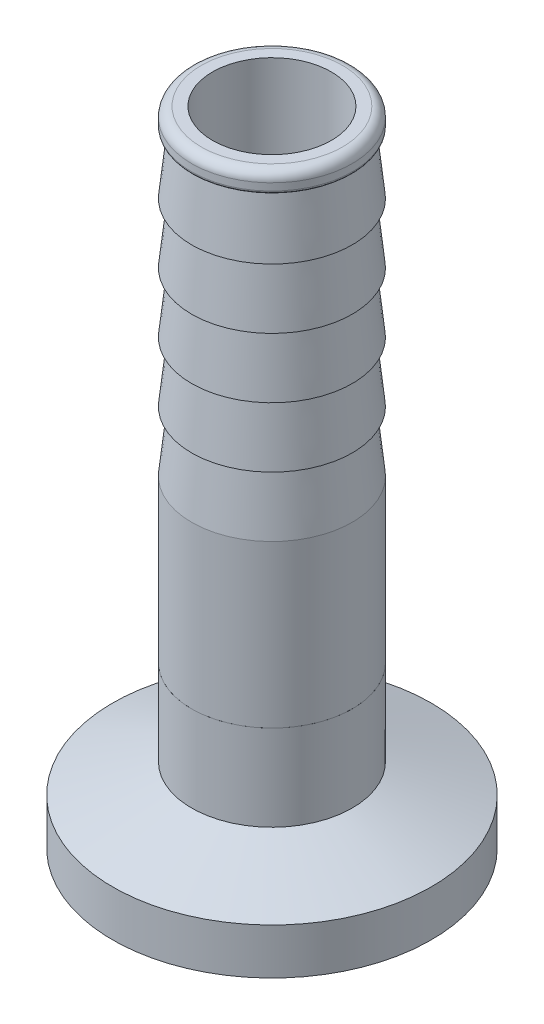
ISO-10303-21;
HEADER;
FILE_DESCRIPTION(('STEP AP214'),'2;1');
FILE_NAME('part.step','',(''),(''),'','','');
FILE_SCHEMA(('AUTOMOTIVE_DESIGN { 1 0 10303 214 1 1 1 1 }'));
ENDSEC;
DATA;
#1=APPLICATION_CONTEXT('core data for automotive mechanical design processes');
#2=APPLICATION_PROTOCOL_DEFINITION('international standard','automotive_design',2000,#1);
#3=PRODUCT_CONTEXT('',#1,'mechanical');
#4=PRODUCT('Part','Part','',(#3));
#5=PRODUCT_RELATED_PRODUCT_CATEGORY('part','',(#4));
#6=PRODUCT_DEFINITION_FORMATION('','',#4);
#7=PRODUCT_DEFINITION_CONTEXT('part definition',#1,'design');
#8=PRODUCT_DEFINITION('design','',#6,#7);
#9=PRODUCT_DEFINITION_SHAPE('','',#8);
#10=(LENGTH_UNIT() NAMED_UNIT(*) SI_UNIT(.MILLI.,.METRE.));
#11=(NAMED_UNIT(*) PLANE_ANGLE_UNIT() SI_UNIT($,.RADIAN.));
#12=(NAMED_UNIT(*) SI_UNIT($,.STERADIAN.) SOLID_ANGLE_UNIT());
#13=UNCERTAINTY_MEASURE_WITH_UNIT(LENGTH_MEASURE(1.E-05),#10,'distance_accuracy_value','');
#14=(GEOMETRIC_REPRESENTATION_CONTEXT(3) GLOBAL_UNCERTAINTY_ASSIGNED_CONTEXT((#13)) GLOBAL_UNIT_ASSIGNED_CONTEXT((#10,
#11,#12)) REPRESENTATION_CONTEXT('',''));
#15=CARTESIAN_POINT('',(0.,0.,0.));
#16=DIRECTION('',(0.,0.,1.));
#17=DIRECTION('',(1.,0.,0.));
#18=AXIS2_PLACEMENT_3D('',#15,#16,#17);
#19=CARTESIAN_POINT('',(6.57153264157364,9.52059035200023,23.3011695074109));
#20=DIRECTION('',(0.,-1.,0.));
#21=DIRECTION('',(0.,0.,-0.999999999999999));
#22=AXIS2_PLACEMENT_3D('',#19,#20,#21);
#23=CYLINDRICAL_SURFACE('',#22,10.922);
#24=CARTESIAN_POINT('',(6.57153264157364,10.8413903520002,23.3011695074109));
#25=DIRECTION('',(0.,-1.,0.));
#26=DIRECTION('',(0.,0.,-0.999999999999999));
#27=AXIS2_PLACEMENT_3D('',#24,#25,#26);
#28=CIRCLE('',#27,10.922);
#29=CARTESIAN_POINT('',(6.57153264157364,10.8413903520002,12.3791695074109));
#30=VERTEX_POINT('',#29);
#31=EDGE_CURVE('P0_E10',#30,#30,#28,.T.);
#32=ORIENTED_EDGE('',*,*,#31,.F.);
#33=EDGE_LOOP('',(#32));
#34=FACE_BOUND('',#33,.T.);
#35=CARTESIAN_POINT('',(6.57153264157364,9.52059035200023,23.3011695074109));
#36=DIRECTION('',(0.,-1.,0.));
#37=DIRECTION('',(0.,0.,-0.999999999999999));
#38=AXIS2_PLACEMENT_3D('',#35,#36,#37);
#39=CIRCLE('',#38,10.922);
#40=CARTESIAN_POINT('',(6.57153264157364,9.52059035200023,12.3791695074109));
#41=VERTEX_POINT('',#40);
#42=EDGE_CURVE('P0_E49',#41,#41,#39,.T.);
#43=ORIENTED_EDGE('',*,*,#42,.T.);
#44=EDGE_LOOP('',(#43));
#45=FACE_BOUND('',#44,.T.);
#46=ADVANCED_FACE('P0_F15',(#34,#45),#23,.F.);
#47=CARTESIAN_POINT('',(6.57153264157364,10.8413903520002,23.3011695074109));
#48=DIRECTION('',(0.,-1.,0.));
#49=DIRECTION('',(0.,0.,-0.999999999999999));
#50=AXIS2_PLACEMENT_3D('',#47,#48,#49);
#51=TOROIDAL_SURFACE('',#50,10.1473,0.7747);
#52=CARTESIAN_POINT('',(6.57153264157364,11.3735892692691,23.3011695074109));
#53=DIRECTION('',(0.,-1.,0.));
#54=DIRECTION('',(0.,0.,-0.999999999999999));
#55=AXIS2_PLACEMENT_3D('',#52,#53,#54);
#56=CIRCLE('',#55,9.58433960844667);
#57=CARTESIAN_POINT('',(6.57153264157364,11.3735892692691,13.7168298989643));
#58=VERTEX_POINT('',#57);
#59=EDGE_CURVE('P0_E21',#58,#58,#56,.T.);
#60=ORIENTED_EDGE('',*,*,#59,.F.);
#61=EDGE_LOOP('',(#60));
#62=FACE_BOUND('',#61,.T.);
#63=ORIENTED_EDGE('',*,*,#31,.T.);
#64=EDGE_LOOP('',(#63));
#65=FACE_BOUND('',#64,.T.);
#66=ADVANCED_FACE('P0_F98',(#62,#65),#51,.F.);
#67=CARTESIAN_POINT('',(6.57153264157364,11.3735892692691,23.3011695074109));
#68=DIRECTION('',(0.,1.,0.));
#69=DIRECTION('',(0.,0.,0.999999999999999));
#70=AXIS2_PLACEMENT_3D('',#67,#68,#69);
#71=CONICAL_SURFACE('',#70,9.58433960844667,0.794623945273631);
#72=CARTESIAN_POINT('',(6.57153264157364,10.4095903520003,23.3011695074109));
#73=DIRECTION('',(0.,-1.,0.));
#74=DIRECTION('',(0.,0.,-0.999999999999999));
#75=AXIS2_PLACEMENT_3D('',#72,#73,#74);
#76=CIRCLE('',#75,8.60238725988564);
#77=CARTESIAN_POINT('',(6.57153264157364,10.4095903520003,14.6987822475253));
#78=VERTEX_POINT('',#77);
#79=EDGE_CURVE('P0_E25',#78,#78,#76,.T.);
#80=ORIENTED_EDGE('',*,*,#79,.F.);
#81=EDGE_LOOP('',(#80));
#82=FACE_BOUND('',#81,.T.);
#83=ORIENTED_EDGE('',*,*,#59,.T.);
#84=EDGE_LOOP('',(#83));
#85=FACE_BOUND('',#84,.T.);
#86=ADVANCED_FACE('P0_F93',(#82,#85),#71,.T.);
#87=CARTESIAN_POINT('',(-2.03085461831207,10.4095903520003,23.3011695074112));
#88=DIRECTION('',(0.,1.,0.));
#89=DIRECTION('',(0.,0.,0.999999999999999));
#90=AXIS2_PLACEMENT_3D('',#87,#88,#89);
#91=PLANE('',#90);
#92=CARTESIAN_POINT('',(6.57153264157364,10.4095903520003,23.3011695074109));
#93=DIRECTION('',(0.,-1.,0.));
#94=DIRECTION('',(0.,0.,-0.999999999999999));
#95=AXIS2_PLACEMENT_3D('',#92,#93,#94);
#96=CIRCLE('',#95,4.699);
#97=CARTESIAN_POINT('',(6.57153264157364,10.4095903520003,18.6021695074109));
#98=VERTEX_POINT('',#97);
#99=EDGE_CURVE('P0_E29',#98,#98,#96,.T.);
#100=ORIENTED_EDGE('',*,*,#99,.F.);
#101=EDGE_LOOP('',(#100));
#102=FACE_BOUND('',#101,.T.);
#103=ORIENTED_EDGE('',*,*,#79,.T.);
#104=EDGE_LOOP('',(#103));
#105=FACE_BOUND('',#104,.T.);
#106=ADVANCED_FACE('P0_F87',(#102,#105),#91,.F.);
#107=CARTESIAN_POINT('',(6.57153264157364,9.52059035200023,23.3011695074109));
#108=DIRECTION('',(0.,-1.,0.));
#109=DIRECTION('',(0.,0.,-0.999999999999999));
#110=AXIS2_PLACEMENT_3D('',#107,#108,#109);
#111=CYLINDRICAL_SURFACE('',#110,4.699);
#112=CARTESIAN_POINT('',(6.57153264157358,22.2205903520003,23.3011695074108));
#113=DIRECTION('',(0.,-1.,0.));
#114=DIRECTION('',(0.,0.,-0.999999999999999));
#115=AXIS2_PLACEMENT_3D('',#112,#113,#114);
#116=CIRCLE('',#115,4.699);
#117=CARTESIAN_POINT('',(6.57153264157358,22.2205903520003,18.6021695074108));
#118=VERTEX_POINT('',#117);
#119=EDGE_CURVE('P0_E34',#118,#118,#116,.T.);
#120=ORIENTED_EDGE('',*,*,#119,.F.);
#121=EDGE_LOOP('',(#120));
#122=FACE_BOUND('',#121,.T.);
#123=ORIENTED_EDGE('',*,*,#99,.T.);
#124=EDGE_LOOP('',(#123));
#125=FACE_BOUND('',#124,.T.);
#126=ADVANCED_FACE('P0_F81',(#122,#125),#111,.F.);
#127=CARTESIAN_POINT('',(1.87253264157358,22.2205903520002,23.3011695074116));
#128=DIRECTION('',(0.,-1.,0.));
#129=DIRECTION('',(0.,0.,-0.999999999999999));
#130=AXIS2_PLACEMENT_3D('',#127,#128,#129);
#131=PLANE('',#130);
#132=CARTESIAN_POINT('',(6.57153264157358,22.2205903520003,23.3011695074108));
#133=DIRECTION('',(0.,-1.,0.));
#134=DIRECTION('',(0.,0.,-0.999999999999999));
#135=AXIS2_PLACEMENT_3D('',#132,#133,#134);
#136=CIRCLE('',#135,6.35);
#137=CARTESIAN_POINT('',(6.57153264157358,22.2205903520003,16.9511695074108));
#138=VERTEX_POINT('',#137);
#139=EDGE_CURVE('P0_E37',#138,#138,#136,.T.);
#140=ORIENTED_EDGE('',*,*,#139,.F.);
#141=EDGE_LOOP('',(#140));
#142=FACE_BOUND('',#141,.T.);
#143=ORIENTED_EDGE('',*,*,#119,.T.);
#144=EDGE_LOOP('',(#143));
#145=FACE_BOUND('',#144,.T.);
#146=ADVANCED_FACE('P0_F75',(#142,#145),#131,.F.);
#147=CARTESIAN_POINT('',(6.57153264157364,9.52059035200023,23.3011695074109));
#148=DIRECTION('',(0.,-1.,0.));
#149=DIRECTION('',(0.,0.,-0.999999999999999));
#150=AXIS2_PLACEMENT_3D('',#147,#148,#149);
#151=CYLINDRICAL_SURFACE('',#150,6.35);
#152=CARTESIAN_POINT('',(6.57153264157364,15.4270219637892,23.3011695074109));
#153=DIRECTION('',(0.,-1.,0.));
#154=DIRECTION('',(0.,0.,-0.999999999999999));
#155=AXIS2_PLACEMENT_3D('',#152,#153,#154);
#156=CIRCLE('',#155,6.35);
#157=CARTESIAN_POINT('',(6.57153264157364,15.4270219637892,16.9511695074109));
#158=VERTEX_POINT('',#157);
#159=EDGE_CURVE('P0_E40',#158,#158,#156,.T.);
#160=ORIENTED_EDGE('',*,*,#159,.F.);
#161=EDGE_LOOP('',(#160));
#162=FACE_BOUND('',#161,.T.);
#163=ORIENTED_EDGE('',*,*,#139,.T.);
#164=EDGE_LOOP('',(#163));
#165=FACE_BOUND('',#164,.T.);
#166=ADVANCED_FACE('P0_F69',(#162,#165),#151,.T.);
#167=CARTESIAN_POINT('',(6.57153264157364,15.4270219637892,23.3011695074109));
#168=DIRECTION('',(0.,-1.,0.));
#169=DIRECTION('',(0.,0.,-0.999999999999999));
#170=AXIS2_PLACEMENT_3D('',#167,#168,#169);
#171=CONICAL_SURFACE('',#170,6.35,1.22173047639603);
#172=CARTESIAN_POINT('',(6.57153264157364,13.1527903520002,23.3011695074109));
#173=DIRECTION('',(0.,-1.,0.));
#174=DIRECTION('',(0.,0.,-0.999999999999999));
#175=AXIS2_PLACEMENT_3D('',#172,#173,#174);
#176=CIRCLE('',#175,12.5984);
#177=CARTESIAN_POINT('',(6.57153264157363,13.1527903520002,10.7027695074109));
#178=VERTEX_POINT('',#177);
#179=EDGE_CURVE('P0_E43',#178,#178,#176,.T.);
#180=ORIENTED_EDGE('',*,*,#179,.F.);
#181=EDGE_LOOP('',(#180));
#182=FACE_BOUND('',#181,.T.);
#183=ORIENTED_EDGE('',*,*,#159,.T.);
#184=EDGE_LOOP('',(#183));
#185=FACE_BOUND('',#184,.T.);
#186=ADVANCED_FACE('P0_F63',(#182,#185),#171,.T.);
#187=CARTESIAN_POINT('',(6.57153264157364,9.52059035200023,23.3011695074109));
#188=DIRECTION('',(0.,-1.,0.));
#189=DIRECTION('',(0.,0.,-0.999999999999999));
#190=AXIS2_PLACEMENT_3D('',#187,#188,#189);
#191=CYLINDRICAL_SURFACE('',#190,12.5984);
#192=CARTESIAN_POINT('',(6.57153264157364,9.52059035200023,23.3011695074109));
#193=DIRECTION('',(0.,-1.,0.));
#194=DIRECTION('',(0.,0.,-0.999999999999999));
#195=AXIS2_PLACEMENT_3D('',#192,#193,#194);
#196=CIRCLE('',#195,12.5984);
#197=CARTESIAN_POINT('',(6.57153264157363,9.52059035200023,10.7027695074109));
#198=VERTEX_POINT('',#197);
#199=EDGE_CURVE('P0_E46',#198,#198,#196,.T.);
#200=ORIENTED_EDGE('',*,*,#199,.F.);
#201=EDGE_LOOP('',(#200));
#202=FACE_BOUND('',#201,.T.);
#203=ORIENTED_EDGE('',*,*,#179,.T.);
#204=EDGE_LOOP('',(#203));
#205=FACE_BOUND('',#204,.T.);
#206=ADVANCED_FACE('P0_F57',(#202,#205),#191,.T.);
#207=CARTESIAN_POINT('',(-6.02686735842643,9.52059035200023,23.3011695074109));
#208=DIRECTION('',(0.,1.,0.));
#209=DIRECTION('',(0.,0.,0.999999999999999));
#210=AXIS2_PLACEMENT_3D('',#207,#208,#209);
#211=PLANE('',#210);
#212=ORIENTED_EDGE('',*,*,#42,.F.);
#213=EDGE_LOOP('',(#212));
#214=FACE_BOUND('',#213,.T.);
#215=ORIENTED_EDGE('',*,*,#199,.T.);
#216=EDGE_LOOP('',(#215));
#217=FACE_BOUND('',#216,.T.);
#218=ADVANCED_FACE('P0_F54',(#214,#217),#211,.F.);
#219=CLOSED_SHELL('',(#46,#66,#86,#106,#126,#146,#166,#186,#206,#218));
#220=MANIFOLD_SOLID_BREP('P0_B1',#219);
#221=CARTESIAN_POINT('',(4.3907118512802,22.2205903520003,17.3374023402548));
#222=DIRECTION('',(0.,-0.999999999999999,0.));
#223=DIRECTION('',(-0.939175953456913,0.,0.343436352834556));
#224=AXIS2_PLACEMENT_3D('',#221,#222,#223);
#225=PLANE('',#224);
#226=CARTESIAN_POINT('',(6.57153264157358,22.2205903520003,23.3011695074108));
#227=DIRECTION('',(0.,-0.999999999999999,0.));
#228=DIRECTION('',(-0.939175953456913,0.,0.343436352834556));
#229=AXIS2_PLACEMENT_3D('',#226,#227,#228);
#230=CIRCLE('',#229,4.699);
#231=CARTESIAN_POINT('',(2.15834483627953,22.2205903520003,24.9149769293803));
#232=VERTEX_POINT('',#231);
#233=EDGE_CURVE('P1_E67',#232,#232,#230,.T.);
#234=ORIENTED_EDGE('',*,*,#233,.F.);
#235=EDGE_LOOP('',(#234));
#236=FACE_BOUND('',#235,.T.);
#237=CARTESIAN_POINT('',(6.57153264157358,22.2205903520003,23.3011695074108));
#238=DIRECTION('',(0.,-0.999999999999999,0.));
#239=DIRECTION('',(-0.939175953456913,0.,0.343436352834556));
#240=AXIS2_PLACEMENT_3D('',#237,#238,#239);
#241=CIRCLE('',#240,6.34999985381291);
#242=CARTESIAN_POINT('',(0.607765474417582,22.2205903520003,25.4819902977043));
#243=VERTEX_POINT('',#242);
#244=EDGE_CURVE('P1_E9',#243,#243,#241,.T.);
#245=ORIENTED_EDGE('',*,*,#244,.T.);
#246=EDGE_LOOP('',(#245));
#247=FACE_BOUND('',#246,.T.);
#248=ADVANCED_FACE('P1_F14',(#236,#247),#225,.T.);
#249=CARTESIAN_POINT('',(6.57153264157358,22.2205903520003,23.3011695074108));
#250=DIRECTION('',(0.,-0.999999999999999,0.));
#251=DIRECTION('',(-0.939175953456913,0.,0.343436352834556));
#252=AXIS2_PLACEMENT_3D('',#249,#250,#251);
#253=CYLINDRICAL_SURFACE('',#252,6.34999985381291);
#254=CARTESIAN_POINT('',(6.57153264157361,34.9967903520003,23.3011695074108));
#255=DIRECTION('',(0.,-0.999999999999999,0.));
#256=DIRECTION('',(-0.939175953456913,0.,0.343436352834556));
#257=AXIS2_PLACEMENT_3D('',#254,#255,#256);
#258=CIRCLE('',#257,6.34999985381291);
#259=CARTESIAN_POINT('',(0.607765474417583,34.9967903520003,25.4819902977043));
#260=VERTEX_POINT('',#259);
#261=EDGE_CURVE('P1_E20',#260,#260,#258,.T.);
#262=CARTESIAN_POINT('',(0.607765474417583,34.9967903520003,25.4819902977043));
#263=CARTESIAN_POINT('',(0.607765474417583,34.8637049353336,25.4819902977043));
#264=CARTESIAN_POINT('',(0.607765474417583,34.730619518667,25.4819902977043));
#265=CARTESIAN_POINT('',(0.607765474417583,34.4644486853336,25.4819902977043));
#266=CARTESIAN_POINT('',(0.607765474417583,34.331363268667,25.4819902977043));
#267=CARTESIAN_POINT('',(0.607765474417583,34.0651924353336,25.4819902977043));
#268=CARTESIAN_POINT('',(0.607765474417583,33.932107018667,25.4819902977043));
#269=CARTESIAN_POINT('',(0.607765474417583,33.6659361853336,25.4819902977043));
#270=CARTESIAN_POINT('',(0.607765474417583,33.532850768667,25.4819902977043));
#271=CARTESIAN_POINT('',(0.607765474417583,33.2666799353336,25.4819902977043));
#272=CARTESIAN_POINT('',(0.607765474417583,33.133594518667,25.4819902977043));
#273=CARTESIAN_POINT('',(0.607765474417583,32.8674236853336,25.4819902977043));
#274=CARTESIAN_POINT('',(0.607765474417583,32.734338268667,25.4819902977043));
#275=CARTESIAN_POINT('',(0.607765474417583,32.4681674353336,25.4819902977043));
#276=CARTESIAN_POINT('',(0.607765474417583,32.335082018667,25.4819902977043));
#277=CARTESIAN_POINT('',(0.607765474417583,32.0689111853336,25.4819902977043));
#278=CARTESIAN_POINT('',(0.607765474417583,31.935825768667,25.4819902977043));
#279=CARTESIAN_POINT('',(0.607765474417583,31.6696549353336,25.4819902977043));
#280=CARTESIAN_POINT('',(0.607765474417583,31.536569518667,25.4819902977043));
#281=CARTESIAN_POINT('',(0.607765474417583,31.2703986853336,25.4819902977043));
#282=CARTESIAN_POINT('',(0.607765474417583,31.137313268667,25.4819902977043));
#283=CARTESIAN_POINT('',(0.607765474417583,30.8711424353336,25.4819902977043));
#284=CARTESIAN_POINT('',(0.607765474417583,30.738057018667,25.4819902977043));
#285=CARTESIAN_POINT('',(0.607765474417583,30.4718861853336,25.4819902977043));
#286=CARTESIAN_POINT('',(0.607765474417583,30.338800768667,25.4819902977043));
#287=CARTESIAN_POINT('',(0.607765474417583,30.0726299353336,25.4819902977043));
#288=CARTESIAN_POINT('',(0.607765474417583,29.939544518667,25.4819902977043));
#289=CARTESIAN_POINT('',(0.607765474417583,29.6733736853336,25.4819902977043));
#290=CARTESIAN_POINT('',(0.607765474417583,29.540288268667,25.4819902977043));
#291=CARTESIAN_POINT('',(0.607765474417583,29.2741174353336,25.4819902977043));
#292=CARTESIAN_POINT('',(0.607765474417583,29.141032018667,25.4819902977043));
#293=CARTESIAN_POINT('',(0.607765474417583,28.8748611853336,25.4819902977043));
#294=CARTESIAN_POINT('',(0.607765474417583,28.741775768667,25.4819902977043));
#295=CARTESIAN_POINT('',(0.607765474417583,28.4756049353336,25.4819902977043));
#296=CARTESIAN_POINT('',(0.607765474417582,28.342519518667,25.4819902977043));
#297=CARTESIAN_POINT('',(0.607765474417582,28.0763486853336,25.4819902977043));
#298=CARTESIAN_POINT('',(0.607765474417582,27.9432632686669,25.4819902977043));
#299=CARTESIAN_POINT('',(0.607765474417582,27.6770924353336,25.4819902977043));
#300=CARTESIAN_POINT('',(0.607765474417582,27.5440070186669,25.4819902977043));
#301=CARTESIAN_POINT('',(0.607765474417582,27.2778361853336,25.4819902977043));
#302=CARTESIAN_POINT('',(0.607765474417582,27.1447507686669,25.4819902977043));
#303=CARTESIAN_POINT('',(0.607765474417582,26.8785799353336,25.4819902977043));
#304=CARTESIAN_POINT('',(0.607765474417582,26.7454945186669,25.4819902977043));
#305=CARTESIAN_POINT('',(0.607765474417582,26.4793236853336,25.4819902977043));
#306=CARTESIAN_POINT('',(0.607765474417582,26.3462382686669,25.4819902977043));
#307=CARTESIAN_POINT('',(0.607765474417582,26.0800674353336,25.4819902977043));
#308=CARTESIAN_POINT('',(0.607765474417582,25.9469820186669,25.4819902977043));
#309=CARTESIAN_POINT('',(0.607765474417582,25.6808111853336,25.4819902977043));
#310=CARTESIAN_POINT('',(0.607765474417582,25.5477257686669,25.4819902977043));
#311=CARTESIAN_POINT('',(0.607765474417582,25.2815549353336,25.4819902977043));
#312=CARTESIAN_POINT('',(0.607765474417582,25.1484695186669,25.4819902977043));
#313=CARTESIAN_POINT('',(0.607765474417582,24.8822986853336,25.4819902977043));
#314=CARTESIAN_POINT('',(0.607765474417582,24.7492132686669,25.4819902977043));
#315=CARTESIAN_POINT('',(0.607765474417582,24.4830424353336,25.4819902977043));
#316=CARTESIAN_POINT('',(0.607765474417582,24.3499570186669,25.4819902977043));
#317=CARTESIAN_POINT('',(0.607765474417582,24.0837861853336,25.4819902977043));
#318=CARTESIAN_POINT('',(0.607765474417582,23.9507007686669,25.4819902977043));
#319=CARTESIAN_POINT('',(0.607765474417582,23.6845299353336,25.4819902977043));
#320=CARTESIAN_POINT('',(0.607765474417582,23.5514445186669,25.4819902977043));
#321=CARTESIAN_POINT('',(0.607765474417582,23.2852736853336,25.4819902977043));
#322=CARTESIAN_POINT('',(0.607765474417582,23.1521882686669,25.4819902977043));
#323=CARTESIAN_POINT('',(0.607765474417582,22.8860174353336,25.4819902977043));
#324=CARTESIAN_POINT('',(0.607765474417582,22.7529320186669,25.4819902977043));
#325=CARTESIAN_POINT('',(0.607765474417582,22.4867611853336,25.4819902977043));
#326=CARTESIAN_POINT('',(0.607765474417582,22.3536757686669,25.4819902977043));
#327=CARTESIAN_POINT('',(0.607765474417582,22.2205903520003,25.4819902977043));
#328=B_SPLINE_CURVE_WITH_KNOTS('',3,(#262,#263,#264,#265,#266,#267,#268,#269,#270,#271,#272,
#273,#274,#275,#276,#277,#278,#279,#280,#281,#282,#283,#284,#285,#286,#287,#288,#289,#290,#291,
#292,#293,#294,#295,#296,#297,#298,#299,#300,#301,#302,#303,#304,#305,#306,#307,#308,#309,#310,
#311,#312,#313,#314,#315,#316,#317,#318,#319,#320,#321,#322,#323,#324,#325,#326,#327),
.UNSPECIFIED.,.F.,.F.,(4,2,2,2,2,2,2,2,2,2,2,2,2,2,2,2,2,2,2,2,2,2,2,2,2,2,2,2,2,2,2,2,4),(0.,
0.399256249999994,0.798512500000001,1.19776874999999,1.597025,1.99628125,2.3955375,2.79479375,
3.19405,3.59330625,3.9925625,4.39181875,4.79107500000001,5.19033125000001,5.58958750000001,
5.98884375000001,6.38810000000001,6.78735625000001,7.18661250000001,7.58586875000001,
7.98512500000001,8.38438125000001,8.78363750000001,9.18289375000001,9.58215000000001,
9.98140625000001,10.3806625,10.77991875,11.179175,11.57843125,11.9776875,12.37694375,12.7762),.UNSPECIFIED.);
#329=EDGE_CURVE('P1_BSEAM83',#260,#243,#328,.T.);
#330=ORIENTED_EDGE('',*,*,#261,.T.);
#331=ORIENTED_EDGE('',*,*,#244,.F.);
#332=ORIENTED_EDGE('',*,*,#329,.T.);
#333=ORIENTED_EDGE('',*,*,#329,.F.);
#334=EDGE_LOOP('',(#330,#332,#331,#333));
#335=FACE_BOUND('',#334,.T.);
#336=ADVANCED_FACE('P1_F83',(#335),#253,.T.);
#337=CARTESIAN_POINT('',(6.57153264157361,34.9967903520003,23.3011695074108));
#338=DIRECTION('',(0.,-0.999999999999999,0.));
#339=DIRECTION('',(-0.939175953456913,0.,0.343436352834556));
#340=AXIS2_PLACEMENT_3D('',#337,#338,#339);
#341=CONICAL_SURFACE('',#340,6.34999985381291,0.106546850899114);
#342=CARTESIAN_POINT('',(6.57153264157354,39.7465903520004,23.3011695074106));
#343=DIRECTION('',(0.,-0.999999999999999,0.));
#344=DIRECTION('',(-0.939175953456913,0.,0.343436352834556));
#345=AXIS2_PLACEMENT_3D('',#342,#343,#344);
#346=CIRCLE('',#345,5.84199985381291);
#347=CARTESIAN_POINT('',(1.08486685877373,39.7465903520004,25.3075246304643));
#348=VERTEX_POINT('',#347);
#349=EDGE_CURVE('P1_E24',#348,#348,#346,.T.);
#350=CARTESIAN_POINT('',(1.08486685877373,39.7465903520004,25.3075246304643));
#351=CARTESIAN_POINT('',(1.07989705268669,39.697113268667,25.3093419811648));
#352=CARTESIAN_POINT('',(1.07492724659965,39.6476361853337,25.3111593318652));
#353=CARTESIAN_POINT('',(1.06498763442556,39.548682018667,25.314794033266));
#354=CARTESIAN_POINT('',(1.06001782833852,39.4992049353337,25.3166113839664));
#355=CARTESIAN_POINT('',(1.05007821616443,39.400250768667,25.3202460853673));
#356=CARTESIAN_POINT('',(1.04510841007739,39.3507736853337,25.3220634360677));
#357=CARTESIAN_POINT('',(1.0351687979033,39.251819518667,25.3256981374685));
#358=CARTESIAN_POINT('',(1.03019899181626,39.2023424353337,25.3275154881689));
#359=CARTESIAN_POINT('',(1.02025937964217,39.103388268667,25.3311501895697));
#360=CARTESIAN_POINT('',(1.01528957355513,39.0539111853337,25.3329675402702));
#361=CARTESIAN_POINT('',(1.00534996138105,38.954957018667,25.336602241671));
#362=CARTESIAN_POINT('',(1.000380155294,38.9054799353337,25.3384195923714));
#363=CARTESIAN_POINT('',(0.990440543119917,38.806525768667,25.3420542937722));
#364=CARTESIAN_POINT('',(0.985470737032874,38.7570486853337,25.3438716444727));
#365=CARTESIAN_POINT('',(0.975531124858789,38.658094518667,25.3475063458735));
#366=CARTESIAN_POINT('',(0.970561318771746,38.6086174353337,25.3493236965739));
#367=CARTESIAN_POINT('',(0.96062170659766,38.509663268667,25.3529583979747));
#368=CARTESIAN_POINT('',(0.955651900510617,38.4601861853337,25.3547757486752));
#369=CARTESIAN_POINT('',(0.945712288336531,38.361232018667,25.358410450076));
#370=CARTESIAN_POINT('',(0.940742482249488,38.3117549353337,25.3602278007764));
#371=CARTESIAN_POINT('',(0.930802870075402,38.212800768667,25.3638625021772));
#372=CARTESIAN_POINT('',(0.92583306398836,38.1633236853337,25.3656798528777));
#373=CARTESIAN_POINT('',(0.915893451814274,38.064369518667,25.3693145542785));
#374=CARTESIAN_POINT('',(0.910923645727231,38.0148924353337,25.3711319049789));
#375=CARTESIAN_POINT('',(0.900984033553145,37.915938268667,25.3747666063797));
#376=CARTESIAN_POINT('',(0.896014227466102,37.8664611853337,25.3765839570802));
#377=CARTESIAN_POINT('',(0.886074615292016,37.767507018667,25.380218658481));
#378=CARTESIAN_POINT('',(0.881104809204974,37.7180299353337,25.3820360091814));
#379=CARTESIAN_POINT('',(0.871165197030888,37.619075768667,25.3856707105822));
#380=CARTESIAN_POINT('',(0.866195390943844,37.5695986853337,25.3874880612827));
#381=CARTESIAN_POINT('',(0.856255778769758,37.470644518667,25.3911227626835));
#382=CARTESIAN_POINT('',(0.851285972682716,37.4211674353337,25.3929401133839));
#383=CARTESIAN_POINT('',(0.84134636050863,37.322213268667,25.3965748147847));
#384=CARTESIAN_POINT('',(0.836376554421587,37.2727361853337,25.3983921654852));
#385=CARTESIAN_POINT('',(0.826436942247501,37.173782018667,25.402026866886));
#386=CARTESIAN_POINT('',(0.821467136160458,37.1243049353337,25.4038442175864));
#387=CARTESIAN_POINT('',(0.811527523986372,37.025350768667,25.4074789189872));
#388=CARTESIAN_POINT('',(0.80655771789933,36.9758736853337,25.4092962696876));
#389=CARTESIAN_POINT('',(0.796618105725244,36.876919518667,25.4129309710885));
#390=CARTESIAN_POINT('',(0.791648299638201,36.8274424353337,25.4147483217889));
#391=CARTESIAN_POINT('',(0.781708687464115,36.728488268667,25.4183830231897));
#392=CARTESIAN_POINT('',(0.776738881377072,36.6790111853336,25.4202003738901));
#393=CARTESIAN_POINT('',(0.766799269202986,36.580057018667,25.423835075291));
#394=CARTESIAN_POINT('',(0.761829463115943,36.5305799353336,25.4256524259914));
#395=CARTESIAN_POINT('',(0.751889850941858,36.431625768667,25.4292871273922));
#396=CARTESIAN_POINT('',(0.746920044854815,36.3821486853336,25.4311044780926));
#397=CARTESIAN_POINT('',(0.736980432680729,36.283194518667,25.4347391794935));
#398=CARTESIAN_POINT('',(0.732010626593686,36.2337174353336,25.4365565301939));
#399=CARTESIAN_POINT('',(0.7220710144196,36.134763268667,25.4401912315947));
#400=CARTESIAN_POINT('',(0.717101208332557,36.0852861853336,25.4420085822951));
#401=CARTESIAN_POINT('',(0.707161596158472,35.986332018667,25.445643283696));
#402=CARTESIAN_POINT('',(0.702191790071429,35.9368549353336,25.4474606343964));
#403=CARTESIAN_POINT('',(0.692252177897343,35.837900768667,25.4510953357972));
#404=CARTESIAN_POINT('',(0.687282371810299,35.7884236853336,25.4529126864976));
#405=CARTESIAN_POINT('',(0.677342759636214,35.689469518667,25.4565473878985));
#406=CARTESIAN_POINT('',(0.672372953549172,35.6399924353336,25.4583647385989));
#407=CARTESIAN_POINT('',(0.662433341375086,35.541038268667,25.4619994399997));
#408=CARTESIAN_POINT('',(0.657463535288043,35.4915611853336,25.4638167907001));
#409=CARTESIAN_POINT('',(0.647523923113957,35.392607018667,25.467451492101));
#410=CARTESIAN_POINT('',(0.642554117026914,35.3431299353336,25.4692688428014));
#411=CARTESIAN_POINT('',(0.632614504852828,35.244175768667,25.4729035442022));
#412=CARTESIAN_POINT('',(0.627644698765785,35.1946986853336,25.4747208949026));
#413=CARTESIAN_POINT('',(0.6177050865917,35.095744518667,25.4783555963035));
#414=CARTESIAN_POINT('',(0.612735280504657,35.0462674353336,25.4801729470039));
#415=CARTESIAN_POINT('',(0.607765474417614,34.9967903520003,25.4819902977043));
#416=B_SPLINE_CURVE_WITH_KNOTS('',3,(#350,#351,#352,#353,#354,#355,#356,#357,#358,#359,#360,
#361,#362,#363,#364,#365,#366,#367,#368,#369,#370,#371,#372,#373,#374,#375,#376,#377,#378,#379,
#380,#381,#382,#383,#384,#385,#386,#387,#388,#389,#390,#391,#392,#393,#394,#395,#396,#397,#398,
#399,#400,#401,#402,#403,#404,#405,#406,#407,#408,#409,#410,#411,#412,#413,#414,#415),
.UNSPECIFIED.,.F.,.F.,(4,2,2,2,2,2,2,2,2,2,2,2,2,2,2,2,2,2,2,2,2,2,2,2,2,2,2,2,2,2,2,2,4),(0.,
0.1492777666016,0.298555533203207,0.447833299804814,0.597111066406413,0.74638883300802,
0.895666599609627,1.04494436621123,1.19422213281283,1.34349989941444,1.49277766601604,
1.64205543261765,1.79133319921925,1.94061096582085,2.08988873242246,2.23916649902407,
2.38844426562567,2.53772203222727,2.68699979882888,2.83627756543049,2.98555533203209,
3.13483309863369,3.2841108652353,3.4333886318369,3.58266639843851,3.73194416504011,
3.88122193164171,4.03049969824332,4.17977746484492,4.32905523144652,4.47833299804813,
4.62761076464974,4.77688853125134),.UNSPECIFIED.);
#417=EDGE_CURVE('P1_BSEAM88',#348,#260,#416,.T.);
#418=ORIENTED_EDGE('',*,*,#349,.T.);
#419=ORIENTED_EDGE('',*,*,#261,.F.);
#420=ORIENTED_EDGE('',*,*,#417,.T.);
#421=ORIENTED_EDGE('',*,*,#417,.F.);
#422=EDGE_LOOP('',(#418,#420,#419,#421));
#423=FACE_BOUND('',#422,.T.);
#424=ADVANCED_FACE('P1_F88',(#423),#341,.T.);
#425=CARTESIAN_POINT('',(4.39071183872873,39.7465903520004,17.3374023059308));
#426=DIRECTION('',(0.,-0.999999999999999,0.));
#427=DIRECTION('',(-0.939175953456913,0.,0.343436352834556));
#428=AXIS2_PLACEMENT_3D('',#425,#426,#427);
#429=PLANE('',#428);
#430=CARTESIAN_POINT('',(6.57153264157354,39.7465903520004,23.3011695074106));
#431=DIRECTION('',(0.,-0.999999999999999,0.));
#432=DIRECTION('',(-0.939175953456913,0.,0.343436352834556));
#433=AXIS2_PLACEMENT_3D('',#430,#431,#432);
#434=CIRCLE('',#433,6.34999989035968);
#435=CARTESIAN_POINT('',(0.607765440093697,39.7465903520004,25.4819903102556));
#436=VERTEX_POINT('',#435);
#437=EDGE_CURVE('P1_E28',#436,#436,#434,.T.);
#438=ORIENTED_EDGE('',*,*,#437,.T.);
#439=EDGE_LOOP('',(#438));
#440=FACE_BOUND('',#439,.T.);
#441=ORIENTED_EDGE('',*,*,#349,.F.);
#442=EDGE_LOOP('',(#441));
#443=FACE_BOUND('',#442,.T.);
#444=ADVANCED_FACE('P1_F92',(#440,#443),#429,.T.);
#445=CARTESIAN_POINT('',(6.57153264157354,39.7465903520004,23.3011695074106));
#446=DIRECTION('',(0.,-0.999999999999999,0.));
#447=DIRECTION('',(-0.939175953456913,0.,0.343436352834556));
#448=AXIS2_PLACEMENT_3D('',#445,#446,#447);
#449=CONICAL_SURFACE('',#448,6.34999989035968,0.106546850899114);
#450=CARTESIAN_POINT('',(6.57153264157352,44.4963903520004,23.3011695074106));
#451=DIRECTION('',(0.,-0.999999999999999,0.));
#452=DIRECTION('',(-0.939175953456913,0.,0.343436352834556));
#453=AXIS2_PLACEMENT_3D('',#450,#451,#452);
#454=CIRCLE('',#453,5.84199989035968);
#455=CARTESIAN_POINT('',(1.08486682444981,44.4963903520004,25.3075246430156));
#456=VERTEX_POINT('',#455);
#457=EDGE_CURVE('P1_E33',#456,#456,#454,.T.);
#458=CARTESIAN_POINT('',(1.08486682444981,44.4963903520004,25.3075246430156));
#459=CARTESIAN_POINT('',(1.07989701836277,44.4469132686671,25.3093419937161));
#460=CARTESIAN_POINT('',(1.07492721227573,44.3974361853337,25.3111593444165));
#461=CARTESIAN_POINT('',(1.06498760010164,44.2984820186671,25.3147940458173));
#462=CARTESIAN_POINT('',(1.0600177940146,44.2490049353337,25.3166113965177));
#463=CARTESIAN_POINT('',(1.05007818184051,44.1500507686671,25.3202460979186));
#464=CARTESIAN_POINT('',(1.04510837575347,44.1005736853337,25.322063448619));
#465=CARTESIAN_POINT('',(1.03516876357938,44.0016195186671,25.3256981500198));
#466=CARTESIAN_POINT('',(1.03019895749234,43.9521424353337,25.3275155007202));
#467=CARTESIAN_POINT('',(1.02025934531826,43.853188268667,25.3311502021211));
#468=CARTESIAN_POINT('',(1.01528953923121,43.8037111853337,25.3329675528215));
#469=CARTESIAN_POINT('',(1.00534992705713,43.7047570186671,25.3366022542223));
#470=CARTESIAN_POINT('',(1.00038012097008,43.6552799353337,25.3384196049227));
#471=CARTESIAN_POINT('',(0.990440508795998,43.5563257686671,25.3420543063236));
#472=CARTESIAN_POINT('',(0.985470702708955,43.5068486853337,25.343871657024));
#473=CARTESIAN_POINT('',(0.975531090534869,43.407894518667,25.3475063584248));
#474=CARTESIAN_POINT('',(0.970561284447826,43.3584174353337,25.3493237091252));
#475=CARTESIAN_POINT('',(0.96062167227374,43.259463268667,25.352958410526));
#476=CARTESIAN_POINT('',(0.955651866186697,43.2099861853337,25.3547757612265));
#477=CARTESIAN_POINT('',(0.945712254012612,43.111032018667,25.3584104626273));
#478=CARTESIAN_POINT('',(0.940742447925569,43.0615549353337,25.3602278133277));
#479=CARTESIAN_POINT('',(0.930802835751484,42.9626007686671,25.3638625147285));
#480=CARTESIAN_POINT('',(0.92583302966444,42.9131236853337,25.365679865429));
#481=CARTESIAN_POINT('',(0.915893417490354,42.814169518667,25.3693145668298));
#482=CARTESIAN_POINT('',(0.910923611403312,42.7646924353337,25.3711319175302));
#483=CARTESIAN_POINT('',(0.900983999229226,42.665738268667,25.374766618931));
#484=CARTESIAN_POINT('',(0.896014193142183,42.6162611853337,25.3765839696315));
#485=CARTESIAN_POINT('',(0.886074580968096,42.517307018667,25.3802186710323));
#486=CARTESIAN_POINT('',(0.881104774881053,42.4678299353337,25.3820360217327));
#487=CARTESIAN_POINT('',(0.871165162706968,42.368875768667,25.3856707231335));
#488=CARTESIAN_POINT('',(0.866195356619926,42.3193986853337,25.387488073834));
#489=CARTESIAN_POINT('',(0.856255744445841,42.220444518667,25.3911227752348));
#490=CARTESIAN_POINT('',(0.851285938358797,42.1709674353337,25.3929401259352));
#491=CARTESIAN_POINT('',(0.841346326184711,42.072013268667,25.396574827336));
#492=CARTESIAN_POINT('',(0.836376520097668,42.0225361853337,25.3983921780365));
#493=CARTESIAN_POINT('',(0.826436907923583,41.923582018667,25.4020268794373));
#494=CARTESIAN_POINT('',(0.82146710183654,41.8741049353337,25.4038442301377));
#495=CARTESIAN_POINT('',(0.811527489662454,41.775150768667,25.4074789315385));
#496=CARTESIAN_POINT('',(0.806557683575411,41.7256736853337,25.409296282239));
#497=CARTESIAN_POINT('',(0.796618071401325,41.626719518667,25.4129309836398));
#498=CARTESIAN_POINT('',(0.791648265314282,41.5772424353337,25.4147483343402));
#499=CARTESIAN_POINT('',(0.781708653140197,41.478288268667,25.418383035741));
#500=CARTESIAN_POINT('',(0.776738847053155,41.4288111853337,25.4202003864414));
#501=CARTESIAN_POINT('',(0.766799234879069,41.329857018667,25.4238350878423));
#502=CARTESIAN_POINT('',(0.761829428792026,41.2803799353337,25.4256524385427));
#503=CARTESIAN_POINT('',(0.751889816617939,41.181425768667,25.4292871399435));
#504=CARTESIAN_POINT('',(0.746920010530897,41.1319486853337,25.4311044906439));
#505=CARTESIAN_POINT('',(0.736980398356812,41.032994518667,25.4347391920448));
#506=CARTESIAN_POINT('',(0.732010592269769,40.9835174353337,25.4365565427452));
#507=CARTESIAN_POINT('',(0.722070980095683,40.884563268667,25.440191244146));
#508=CARTESIAN_POINT('',(0.717101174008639,40.8350861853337,25.4420085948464));
#509=CARTESIAN_POINT('',(0.707161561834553,40.736132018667,25.4456432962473));
#510=CARTESIAN_POINT('',(0.702191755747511,40.6866549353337,25.4474606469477));
#511=CARTESIAN_POINT('',(0.692252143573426,40.587700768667,25.4510953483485));
#512=CARTESIAN_POINT('',(0.687282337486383,40.5382236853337,25.4529126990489));
#513=CARTESIAN_POINT('',(0.677342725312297,40.439269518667,25.4565474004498));
#514=CARTESIAN_POINT('',(0.672372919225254,40.3897924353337,25.4583647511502));
#515=CARTESIAN_POINT('',(0.662433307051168,40.290838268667,25.461999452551));
#516=CARTESIAN_POINT('',(0.657463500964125,40.2413611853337,25.4638168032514));
#517=CARTESIAN_POINT('',(0.64752388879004,40.142407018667,25.4674515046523));
#518=CARTESIAN_POINT('',(0.642554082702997,40.0929299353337,25.4692688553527));
#519=CARTESIAN_POINT('',(0.632614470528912,39.993975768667,25.4729035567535));
#520=CARTESIAN_POINT('',(0.627644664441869,39.9444986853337,25.4747209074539));
#521=CARTESIAN_POINT('',(0.617705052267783,39.845544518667,25.4783556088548));
#522=CARTESIAN_POINT('',(0.61273524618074,39.7960674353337,25.4801729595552));
#523=CARTESIAN_POINT('',(0.607765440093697,39.7465903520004,25.4819903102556));
#524=B_SPLINE_CURVE_WITH_KNOTS('',3,(#458,#459,#460,#461,#462,#463,#464,#465,#466,#467,#468,
#469,#470,#471,#472,#473,#474,#475,#476,#477,#478,#479,#480,#481,#482,#483,#484,#485,#486,#487,
#488,#489,#490,#491,#492,#493,#494,#495,#496,#497,#498,#499,#500,#501,#502,#503,#504,#505,#506,
#507,#508,#509,#510,#511,#512,#513,#514,#515,#516,#517,#518,#519,#520,#521,#522,#523),
.UNSPECIFIED.,.F.,.F.,(4,2,2,2,2,2,2,2,2,2,2,2,2,2,2,2,2,2,2,2,2,2,2,2,2,2,2,2,2,2,2,2,4),(0.,
0.1492777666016,0.2985555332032,0.447833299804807,0.597111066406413,0.746388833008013,
0.895666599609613,1.04494436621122,1.19422213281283,1.34349989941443,1.49277766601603,
1.64205543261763,1.79133319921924,1.94061096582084,2.08988873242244,2.23916649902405,
2.38844426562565,2.53772203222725,2.68699979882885,2.83627756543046,2.98555533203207,
3.13483309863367,3.28411086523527,3.43338863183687,3.58266639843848,3.73194416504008,
3.88122193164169,4.03049969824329,4.17977746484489,4.32905523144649,4.4783329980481,
4.6276107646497,4.7768885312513),.UNSPECIFIED.);
#525=EDGE_CURVE('P1_BSEAM99',#456,#436,#524,.T.);
#526=ORIENTED_EDGE('',*,*,#457,.T.);
#527=ORIENTED_EDGE('',*,*,#437,.F.);
#528=ORIENTED_EDGE('',*,*,#525,.T.);
#529=ORIENTED_EDGE('',*,*,#525,.F.);
#530=EDGE_LOOP('',(#526,#528,#527,#529));
#531=FACE_BOUND('',#530,.T.);
#532=ADVANCED_FACE('P1_F99',(#531),#449,.T.);
#533=CARTESIAN_POINT('',(4.39071182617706,44.4963903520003,17.3374022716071));
#534=DIRECTION('',(0.,-0.999999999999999,0.));
#535=DIRECTION('',(-0.939175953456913,0.,0.343436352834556));
#536=AXIS2_PLACEMENT_3D('',#533,#534,#535);
#537=PLANE('',#536);
#538=CARTESIAN_POINT('',(6.57153264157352,44.4963903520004,23.3011695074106));
#539=DIRECTION('',(0.,-0.999999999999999,0.));
#540=DIRECTION('',(-0.939175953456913,0.,0.343436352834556));
#541=AXIS2_PLACEMENT_3D('',#538,#539,#540);
#542=CIRCLE('',#541,6.34999992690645);
#543=CARTESIAN_POINT('',(0.607765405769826,44.4963903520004,25.4819903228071));
#544=VERTEX_POINT('',#543);
#545=EDGE_CURVE('P1_E36',#544,#544,#542,.T.);
#546=ORIENTED_EDGE('',*,*,#545,.T.);
#547=EDGE_LOOP('',(#546));
#548=FACE_BOUND('',#547,.T.);
#549=ORIENTED_EDGE('',*,*,#457,.F.);
#550=EDGE_LOOP('',(#549));
#551=FACE_BOUND('',#550,.T.);
#552=ADVANCED_FACE('P1_F103',(#548,#551),#537,.T.);
#553=CARTESIAN_POINT('',(6.57153264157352,44.4963903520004,23.3011695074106));
#554=DIRECTION('',(0.,-0.999999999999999,0.));
#555=DIRECTION('',(-0.939175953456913,0.,0.343436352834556));
#556=AXIS2_PLACEMENT_3D('',#553,#554,#555);
#557=CONICAL_SURFACE('',#556,6.34999992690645,0.106546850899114);
#558=CARTESIAN_POINT('',(6.57153264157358,49.2461903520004,23.3011695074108));
#559=DIRECTION('',(0.,-0.999999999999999,0.));
#560=DIRECTION('',(-0.939175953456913,0.,0.343436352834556));
#561=AXIS2_PLACEMENT_3D('',#558,#559,#560);
#562=CIRCLE('',#561,5.84199992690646);
#563=CARTESIAN_POINT('',(1.08486679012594,49.2461903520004,25.3075246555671));
#564=VERTEX_POINT('',#563);
#565=EDGE_CURVE('P1_E39',#564,#564,#562,.T.);
#566=CARTESIAN_POINT('',(1.08486679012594,49.2461903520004,25.3075246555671));
#567=CARTESIAN_POINT('',(1.07989698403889,49.196713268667,25.3093420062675));
#568=CARTESIAN_POINT('',(1.07492717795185,49.1472361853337,25.311159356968));
#569=CARTESIAN_POINT('',(1.06498756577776,49.048282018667,25.3147940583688));
#570=CARTESIAN_POINT('',(1.06001775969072,48.9988049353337,25.3166114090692));
#571=CARTESIAN_POINT('',(1.05007814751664,48.899850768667,25.32024611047));
#572=CARTESIAN_POINT('',(1.04510834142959,48.8503736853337,25.3220634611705));
#573=CARTESIAN_POINT('',(1.03516872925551,48.751419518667,25.3256981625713));
#574=CARTESIAN_POINT('',(1.03019892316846,48.7019424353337,25.3275155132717));
#575=CARTESIAN_POINT('',(1.02025931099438,48.602988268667,25.3311502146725));
#576=CARTESIAN_POINT('',(1.01528950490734,48.5535111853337,25.332967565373));
#577=CARTESIAN_POINT('',(1.00534989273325,48.454557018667,25.3366022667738));
#578=CARTESIAN_POINT('',(1.00038008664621,48.4050799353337,25.3384196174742));
#579=CARTESIAN_POINT('',(0.990440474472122,48.306125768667,25.342054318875));
#580=CARTESIAN_POINT('',(0.985470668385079,48.2566486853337,25.3438716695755));
#581=CARTESIAN_POINT('',(0.975531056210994,48.157694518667,25.3475063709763));
#582=CARTESIAN_POINT('',(0.970561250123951,48.1082174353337,25.3493237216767));
#583=CARTESIAN_POINT('',(0.960621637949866,48.009263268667,25.3529584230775));
#584=CARTESIAN_POINT('',(0.955651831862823,47.9597861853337,25.3547757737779));
#585=CARTESIAN_POINT('',(0.945712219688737,47.860832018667,25.3584104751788));
#586=CARTESIAN_POINT('',(0.940742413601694,47.8113549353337,25.3602278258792));
#587=CARTESIAN_POINT('',(0.930802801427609,47.712400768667,25.36386252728));
#588=CARTESIAN_POINT('',(0.925832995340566,47.6629236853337,25.3656798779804));
#589=CARTESIAN_POINT('',(0.91589338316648,47.563969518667,25.3693145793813));
#590=CARTESIAN_POINT('',(0.910923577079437,47.5144924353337,25.3711319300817));
#591=CARTESIAN_POINT('',(0.900983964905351,47.415538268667,25.3747666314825));
#592=CARTESIAN_POINT('',(0.896014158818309,47.3660611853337,25.3765839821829));
#593=CARTESIAN_POINT('',(0.886074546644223,47.267107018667,25.3802186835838));
#594=CARTESIAN_POINT('',(0.881104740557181,47.2176299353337,25.3820360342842));
#595=CARTESIAN_POINT('',(0.871165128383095,47.118675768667,25.385670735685));
#596=CARTESIAN_POINT('',(0.866195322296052,47.0691986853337,25.3874880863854));
#597=CARTESIAN_POINT('',(0.856255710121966,46.970244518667,25.3911227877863));
#598=CARTESIAN_POINT('',(0.851285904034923,46.9207674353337,25.3929401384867));
#599=CARTESIAN_POINT('',(0.841346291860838,46.821813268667,25.3965748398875));
#600=CARTESIAN_POINT('',(0.836376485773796,46.7723361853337,25.3983921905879));
#601=CARTESIAN_POINT('',(0.82643687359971,46.673382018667,25.4020268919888));
#602=CARTESIAN_POINT('',(0.821467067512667,46.6239049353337,25.4038442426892));
#603=CARTESIAN_POINT('',(0.811527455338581,46.524950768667,25.40747894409));
#604=CARTESIAN_POINT('',(0.806557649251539,46.4754736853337,25.4092962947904));
#605=CARTESIAN_POINT('',(0.796618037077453,46.376519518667,25.4129309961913));
#606=CARTESIAN_POINT('',(0.79164823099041,46.3270424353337,25.4147483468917));
#607=CARTESIAN_POINT('',(0.781708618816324,46.228088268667,25.4183830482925));
#608=CARTESIAN_POINT('',(0.776738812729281,46.1786111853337,25.4202003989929));
#609=CARTESIAN_POINT('',(0.766799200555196,46.079657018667,25.4238351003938));
#610=CARTESIAN_POINT('',(0.761829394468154,46.0301799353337,25.4256524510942));
#611=CARTESIAN_POINT('',(0.751889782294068,45.931225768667,25.429287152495));
#612=CARTESIAN_POINT('',(0.746919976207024,45.8817486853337,25.4311045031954));
#613=CARTESIAN_POINT('',(0.736980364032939,45.782794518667,25.4347392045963));
#614=CARTESIAN_POINT('',(0.732010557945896,45.7333174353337,25.4365565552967));
#615=CARTESIAN_POINT('',(0.722070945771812,45.634363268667,25.4401912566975));
#616=CARTESIAN_POINT('',(0.717101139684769,45.5848861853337,25.4420086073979));
#617=CARTESIAN_POINT('',(0.707161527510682,45.4859320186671,25.4456433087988));
#618=CARTESIAN_POINT('',(0.702191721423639,45.4364549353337,25.4474606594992));
#619=CARTESIAN_POINT('',(0.692252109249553,45.337500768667,25.4510953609));
#620=CARTESIAN_POINT('',(0.687282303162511,45.2880236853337,25.4529127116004));
#621=CARTESIAN_POINT('',(0.677342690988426,45.1890695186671,25.4565474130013));
#622=CARTESIAN_POINT('',(0.672372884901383,45.1395924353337,25.4583647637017));
#623=CARTESIAN_POINT('',(0.662433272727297,45.0406382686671,25.4619994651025));
#624=CARTESIAN_POINT('',(0.657463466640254,44.9911611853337,25.4638168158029));
#625=CARTESIAN_POINT('',(0.647523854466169,44.8922070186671,25.4674515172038));
#626=CARTESIAN_POINT('',(0.642554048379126,44.8427299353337,25.4692688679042));
#627=CARTESIAN_POINT('',(0.63261443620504,44.7437757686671,25.472903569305));
#628=CARTESIAN_POINT('',(0.627644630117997,44.6942986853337,25.4747209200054));
#629=CARTESIAN_POINT('',(0.617705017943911,44.5953445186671,25.4783556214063));
#630=CARTESIAN_POINT('',(0.612735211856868,44.5458674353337,25.4801729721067));
#631=CARTESIAN_POINT('',(0.607765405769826,44.4963903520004,25.4819903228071));
#632=B_SPLINE_CURVE_WITH_KNOTS('',3,(#566,#567,#568,#569,#570,#571,#572,#573,#574,#575,#576,
#577,#578,#579,#580,#581,#582,#583,#584,#585,#586,#587,#588,#589,#590,#591,#592,#593,#594,#595,
#596,#597,#598,#599,#600,#601,#602,#603,#604,#605,#606,#607,#608,#609,#610,#611,#612,#613,#614,
#615,#616,#617,#618,#619,#620,#621,#622,#623,#624,#625,#626,#627,#628,#629,#630,#631),
.UNSPECIFIED.,.F.,.F.,(4,2,2,2,2,2,2,2,2,2,2,2,2,2,2,2,2,2,2,2,2,2,2,2,2,2,2,2,2,2,2,2,4),(0.,
0.1492777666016,0.2985555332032,0.4478332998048,0.597111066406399,0.746388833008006,
0.895666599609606,1.04494436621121,1.19422213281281,1.34349989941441,1.49277766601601,
1.64205543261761,1.79133319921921,1.94061096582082,2.08988873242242,2.23916649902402,
2.38844426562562,2.53772203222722,2.68699979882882,2.83627756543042,2.98555533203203,
3.13483309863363,3.28411086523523,3.43338863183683,3.58266639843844,3.73194416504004,
3.88122193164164,4.03049969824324,4.17977746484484,4.32905523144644,4.47833299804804,
4.62761076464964,4.77688853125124),.UNSPECIFIED.);
#633=EDGE_CURVE('P1_BSEAM107',#564,#544,#632,.T.);
#634=ORIENTED_EDGE('',*,*,#565,.T.);
#635=ORIENTED_EDGE('',*,*,#545,.F.);
#636=ORIENTED_EDGE('',*,*,#633,.T.);
#637=ORIENTED_EDGE('',*,*,#633,.F.);
#638=EDGE_LOOP('',(#634,#636,#635,#637));
#639=FACE_BOUND('',#638,.T.);
#640=ADVANCED_FACE('P1_F107',(#639),#557,.T.);
#641=CARTESIAN_POINT('',(4.3907118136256,49.2461903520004,17.337402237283));
#642=DIRECTION('',(0.,-0.999999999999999,0.));
#643=DIRECTION('',(-0.939175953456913,0.,0.343436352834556));
#644=AXIS2_PLACEMENT_3D('',#641,#642,#643);
#645=PLANE('',#644);
#646=CARTESIAN_POINT('',(6.57153264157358,49.2461903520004,23.3011695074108));
#647=DIRECTION('',(0.,-0.999999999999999,0.));
#648=DIRECTION('',(-0.939175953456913,0.,0.343436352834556));
#649=AXIS2_PLACEMENT_3D('',#646,#647,#648);
#650=CIRCLE('',#649,6.34999996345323);
#651=CARTESIAN_POINT('',(0.607765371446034,49.2461903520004,25.4819903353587));
#652=VERTEX_POINT('',#651);
#653=EDGE_CURVE('P1_E42',#652,#652,#650,.T.);
#654=ORIENTED_EDGE('',*,*,#653,.T.);
#655=EDGE_LOOP('',(#654));
#656=FACE_BOUND('',#655,.T.);
#657=ORIENTED_EDGE('',*,*,#565,.F.);
#658=EDGE_LOOP('',(#657));
#659=FACE_BOUND('',#658,.T.);
#660=ADVANCED_FACE('P1_F111',(#656,#659),#645,.T.);
#661=CARTESIAN_POINT('',(6.57153264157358,49.2461903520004,23.3011695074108));
#662=DIRECTION('',(0.,-0.999999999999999,0.));
#663=DIRECTION('',(-0.939175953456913,0.,0.343436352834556));
#664=AXIS2_PLACEMENT_3D('',#661,#662,#663);
#665=CONICAL_SURFACE('',#664,6.34999996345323,0.106546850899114);
#666=CARTESIAN_POINT('',(6.57153264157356,53.9959903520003,23.3011695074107));
#667=DIRECTION('',(0.,-0.999999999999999,0.));
#668=DIRECTION('',(-0.939175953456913,0.,0.343436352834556));
#669=AXIS2_PLACEMENT_3D('',#666,#667,#668);
#670=CIRCLE('',#669,5.84199996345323);
#671=CARTESIAN_POINT('',(1.08486675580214,53.9959903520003,25.3075246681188));
#672=VERTEX_POINT('',#671);
#673=EDGE_CURVE('P1_E45',#672,#672,#670,.T.);
#674=CARTESIAN_POINT('',(1.08486675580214,53.9959903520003,25.3075246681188));
#675=CARTESIAN_POINT('',(1.07989694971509,53.9465132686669,25.3093420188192));
#676=CARTESIAN_POINT('',(1.07492714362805,53.8970361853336,25.3111593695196));
#677=CARTESIAN_POINT('',(1.06498753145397,53.7980820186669,25.3147940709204));
#678=CARTESIAN_POINT('',(1.06001772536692,53.7486049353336,25.3166114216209));
#679=CARTESIAN_POINT('',(1.05007811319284,53.6496507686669,25.3202461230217));
#680=CARTESIAN_POINT('',(1.04510830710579,53.6001736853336,25.3220634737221));
#681=CARTESIAN_POINT('',(1.03516869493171,53.5012195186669,25.3256981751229));
#682=CARTESIAN_POINT('',(1.03019888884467,53.4517424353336,25.3275155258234));
#683=CARTESIAN_POINT('',(1.02025927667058,53.3527882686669,25.3311502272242));
#684=CARTESIAN_POINT('',(1.01528947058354,53.3033111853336,25.3329675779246));
#685=CARTESIAN_POINT('',(1.00534985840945,53.2043570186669,25.3366022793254));
#686=CARTESIAN_POINT('',(1.00038005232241,53.1548799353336,25.3384196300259));
#687=CARTESIAN_POINT('',(0.990440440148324,53.0559257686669,25.3420543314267));
#688=CARTESIAN_POINT('',(0.985470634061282,53.0064486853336,25.3438716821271));
#689=CARTESIAN_POINT('',(0.975531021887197,52.907494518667,25.3475063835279));
#690=CARTESIAN_POINT('',(0.970561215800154,52.8580174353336,25.3493237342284));
#691=CARTESIAN_POINT('',(0.960621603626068,52.7590632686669,25.3529584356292));
#692=CARTESIAN_POINT('',(0.955651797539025,52.7095861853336,25.3547757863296));
#693=CARTESIAN_POINT('',(0.94571218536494,52.610632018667,25.3584104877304));
#694=CARTESIAN_POINT('',(0.940742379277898,52.5611549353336,25.3602278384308));
#695=CARTESIAN_POINT('',(0.930802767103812,52.462200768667,25.3638625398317));
#696=CARTESIAN_POINT('',(0.925832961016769,52.4127236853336,25.3656798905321));
#697=CARTESIAN_POINT('',(0.915893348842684,52.313769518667,25.3693145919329));
#698=CARTESIAN_POINT('',(0.910923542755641,52.2642924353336,25.3711319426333));
#699=CARTESIAN_POINT('',(0.900983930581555,52.165338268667,25.3747666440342));
#700=CARTESIAN_POINT('',(0.896014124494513,52.1158611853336,25.3765839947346));
#701=CARTESIAN_POINT('',(0.886074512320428,52.016907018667,25.3802186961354));
#702=CARTESIAN_POINT('',(0.881104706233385,51.9674299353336,25.3820360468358));
#703=CARTESIAN_POINT('',(0.871165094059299,51.868475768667,25.3856707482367));
#704=CARTESIAN_POINT('',(0.866195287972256,51.8189986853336,25.3874880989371));
#705=CARTESIAN_POINT('',(0.856255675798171,51.720044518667,25.3911228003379));
#706=CARTESIAN_POINT('',(0.851285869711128,51.6705674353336,25.3929401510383));
#707=CARTESIAN_POINT('',(0.841346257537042,51.571613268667,25.3965748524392));
#708=CARTESIAN_POINT('',(0.83637645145,51.5221361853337,25.3983922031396));
#709=CARTESIAN_POINT('',(0.826436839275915,51.423182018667,25.4020269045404));
#710=CARTESIAN_POINT('',(0.821467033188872,51.3737049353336,25.4038442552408));
#711=CARTESIAN_POINT('',(0.811527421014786,51.274750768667,25.4074789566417));
#712=CARTESIAN_POINT('',(0.806557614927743,51.2252736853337,25.4092963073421));
#713=CARTESIAN_POINT('',(0.796618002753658,51.126319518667,25.4129310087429));
#714=CARTESIAN_POINT('',(0.791648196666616,51.0768424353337,25.4147483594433));
#715=CARTESIAN_POINT('',(0.78170858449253,50.977888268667,25.4183830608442));
#716=CARTESIAN_POINT('',(0.776738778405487,50.9284111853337,25.4202004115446));
#717=CARTESIAN_POINT('',(0.766799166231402,50.829457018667,25.4238351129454));
#718=CARTESIAN_POINT('',(0.761829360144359,50.7799799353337,25.4256524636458));
#719=CARTESIAN_POINT('',(0.751889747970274,50.681025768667,25.4292871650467));
#720=CARTESIAN_POINT('',(0.746919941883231,50.6315486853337,25.4311045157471));
#721=CARTESIAN_POINT('',(0.736980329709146,50.532594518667,25.4347392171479));
#722=CARTESIAN_POINT('',(0.732010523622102,50.4831174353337,25.4365565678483));
#723=CARTESIAN_POINT('',(0.722070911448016,50.384163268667,25.4401912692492));
#724=CARTESIAN_POINT('',(0.717101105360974,50.3346861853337,25.4420086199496));
#725=CARTESIAN_POINT('',(0.707161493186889,50.235732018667,25.4456433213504));
#726=CARTESIAN_POINT('',(0.702191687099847,50.1862549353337,25.4474606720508));
#727=CARTESIAN_POINT('',(0.692252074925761,50.087300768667,25.4510953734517));
#728=CARTESIAN_POINT('',(0.687282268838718,50.0378236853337,25.4529127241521));
#729=CARTESIAN_POINT('',(0.677342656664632,49.938869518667,25.4565474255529));
#730=CARTESIAN_POINT('',(0.67237285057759,49.8893924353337,25.4583647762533));
#731=CARTESIAN_POINT('',(0.662433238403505,49.790438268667,25.4619994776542));
#732=CARTESIAN_POINT('',(0.657463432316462,49.7409611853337,25.4638168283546));
#733=CARTESIAN_POINT('',(0.647523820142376,49.642007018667,25.4674515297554));
#734=CARTESIAN_POINT('',(0.642554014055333,49.5925299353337,25.4692688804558));
#735=CARTESIAN_POINT('',(0.632614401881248,49.493575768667,25.4729035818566));
#736=CARTESIAN_POINT('',(0.627644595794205,49.4440986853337,25.4747209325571));
#737=CARTESIAN_POINT('',(0.61770498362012,49.345144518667,25.4783556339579));
#738=CARTESIAN_POINT('',(0.612735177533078,49.2956674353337,25.4801729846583));
#739=CARTESIAN_POINT('',(0.607765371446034,49.2461903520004,25.4819903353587));
#740=B_SPLINE_CURVE_WITH_KNOTS('',3,(#674,#675,#676,#677,#678,#679,#680,#681,#682,#683,#684,
#685,#686,#687,#688,#689,#690,#691,#692,#693,#694,#695,#696,#697,#698,#699,#700,#701,#702,#703,
#704,#705,#706,#707,#708,#709,#710,#711,#712,#713,#714,#715,#716,#717,#718,#719,#720,#721,#722,
#723,#724,#725,#726,#727,#728,#729,#730,#731,#732,#733,#734,#735,#736,#737,#738,#739),
.UNSPECIFIED.,.F.,.F.,(4,2,2,2,2,2,2,2,2,2,2,2,2,2,2,2,2,2,2,2,2,2,2,2,2,2,2,2,2,2,2,2,4),(0.,
0.1492777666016,0.298555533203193,0.447833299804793,0.597111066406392,0.746388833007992,
0.895666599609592,1.04494436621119,1.19422213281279,1.34349989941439,1.49277766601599,
1.64205543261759,1.79133319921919,1.94061096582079,2.08988873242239,2.23916649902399,
2.38844426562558,2.53772203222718,2.68699979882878,2.83627756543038,2.98555533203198,
3.13483309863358,3.28411086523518,3.43338863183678,3.58266639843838,3.73194416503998,
3.88122193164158,4.03049969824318,4.17977746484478,4.32905523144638,4.47833299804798,
4.62761076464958,4.77688853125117),.UNSPECIFIED.);
#741=EDGE_CURVE('P1_BSEAM115',#672,#652,#740,.T.);
#742=ORIENTED_EDGE('',*,*,#673,.T.);
#743=ORIENTED_EDGE('',*,*,#653,.F.);
#744=ORIENTED_EDGE('',*,*,#741,.T.);
#745=ORIENTED_EDGE('',*,*,#741,.F.);
#746=EDGE_LOOP('',(#742,#744,#743,#745));
#747=FACE_BOUND('',#746,.T.);
#748=ADVANCED_FACE('P1_F115',(#747),#665,.T.);
#749=CARTESIAN_POINT('',(4.3907118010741,53.9959903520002,17.3374022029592));
#750=DIRECTION('',(0.,-0.999999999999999,0.));
#751=DIRECTION('',(-0.939175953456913,0.,0.343436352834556));
#752=AXIS2_PLACEMENT_3D('',#749,#750,#751);
#753=PLANE('',#752);
#754=CARTESIAN_POINT('',(6.57153264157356,53.9959903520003,23.3011695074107));
#755=DIRECTION('',(0.,-0.999999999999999,0.));
#756=DIRECTION('',(-0.939175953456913,0.,0.343436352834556));
#757=AXIS2_PLACEMENT_3D('',#754,#755,#756);
#758=CIRCLE('',#757,6.35);
#759=CARTESIAN_POINT('',(0.607765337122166,53.9959903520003,25.4819903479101));
#760=VERTEX_POINT('',#759);
#761=EDGE_CURVE('P1_E48',#760,#760,#758,.T.);
#762=ORIENTED_EDGE('',*,*,#761,.T.);
#763=EDGE_LOOP('',(#762));
#764=FACE_BOUND('',#763,.T.);
#765=ORIENTED_EDGE('',*,*,#673,.F.);
#766=EDGE_LOOP('',(#765));
#767=FACE_BOUND('',#766,.T.);
#768=ADVANCED_FACE('P1_F119',(#764,#767),#753,.T.);
#769=CARTESIAN_POINT('',(6.57153264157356,53.9959903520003,23.3011695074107));
#770=DIRECTION('',(0.,-0.999999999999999,0.));
#771=DIRECTION('',(-0.939175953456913,0.,0.343436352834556));
#772=AXIS2_PLACEMENT_3D('',#769,#770,#771);
#773=CONICAL_SURFACE('',#772,6.35,0.106546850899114);
#774=CARTESIAN_POINT('',(6.57153264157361,58.7457903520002,23.3011695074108));
#775=DIRECTION('',(0.,-0.999999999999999,0.));
#776=DIRECTION('',(-0.939175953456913,0.,0.343436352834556));
#777=AXIS2_PLACEMENT_3D('',#774,#775,#776);
#778=CIRCLE('',#777,5.842);
#779=CARTESIAN_POINT('',(1.08486672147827,58.7457903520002,25.3075246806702));
#780=VERTEX_POINT('',#779);
#781=EDGE_CURVE('P1_E51',#780,#780,#778,.T.);
#782=CARTESIAN_POINT('',(1.08486672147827,58.7457903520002,25.3075246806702));
#783=CARTESIAN_POINT('',(1.07989691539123,58.6963132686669,25.3093420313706));
#784=CARTESIAN_POINT('',(1.07492710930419,58.6468361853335,25.311159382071));
#785=CARTESIAN_POINT('',(1.0649874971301,58.5478820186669,25.3147940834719));
#786=CARTESIAN_POINT('',(1.06001769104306,58.4984049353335,25.3166114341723));
#787=CARTESIAN_POINT('',(1.05007807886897,58.3994507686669,25.3202461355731));
#788=CARTESIAN_POINT('',(1.04510827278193,58.3499736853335,25.3220634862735));
#789=CARTESIAN_POINT('',(1.03516866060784,58.2510195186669,25.3256981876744));
#790=CARTESIAN_POINT('',(1.0301988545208,58.2015424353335,25.3275155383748));
#791=CARTESIAN_POINT('',(1.02025924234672,58.1025882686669,25.3311502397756));
#792=CARTESIAN_POINT('',(1.01528943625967,58.0531111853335,25.332967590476));
#793=CARTESIAN_POINT('',(1.00534982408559,57.9541570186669,25.3366022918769));
#794=CARTESIAN_POINT('',(1.00038001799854,57.9046799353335,25.3384196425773));
#795=CARTESIAN_POINT('',(0.990440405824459,57.8057257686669,25.3420543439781));
#796=CARTESIAN_POINT('',(0.985470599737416,57.7562486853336,25.3438716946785));
#797=CARTESIAN_POINT('',(0.975530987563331,57.6572945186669,25.3475063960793));
#798=CARTESIAN_POINT('',(0.970561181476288,57.6078174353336,25.3493237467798));
#799=CARTESIAN_POINT('',(0.960621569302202,57.5088632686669,25.3529584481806));
#800=CARTESIAN_POINT('',(0.955651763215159,57.4593861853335,25.354775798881));
#801=CARTESIAN_POINT('',(0.945712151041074,57.3604320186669,25.3584105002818));
#802=CARTESIAN_POINT('',(0.940742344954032,57.3109549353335,25.3602278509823));
#803=CARTESIAN_POINT('',(0.930802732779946,57.2120007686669,25.3638625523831));
#804=CARTESIAN_POINT('',(0.925832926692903,57.1625236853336,25.3656799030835));
#805=CARTESIAN_POINT('',(0.915893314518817,57.0635695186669,25.3693146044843));
#806=CARTESIAN_POINT('',(0.910923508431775,57.0140924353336,25.3711319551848));
#807=CARTESIAN_POINT('',(0.90098389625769,56.9151382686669,25.3747666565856));
#808=CARTESIAN_POINT('',(0.896014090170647,56.8656611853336,25.376584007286));
#809=CARTESIAN_POINT('',(0.886074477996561,56.7667070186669,25.3802187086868));
#810=CARTESIAN_POINT('',(0.881104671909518,56.7172299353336,25.3820360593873));
#811=CARTESIAN_POINT('',(0.871165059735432,56.6182757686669,25.3856707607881));
#812=CARTESIAN_POINT('',(0.866195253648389,56.5687986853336,25.3874881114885));
#813=CARTESIAN_POINT('',(0.856255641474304,56.4698445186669,25.3911228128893));
#814=CARTESIAN_POINT('',(0.851285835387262,56.4203674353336,25.3929401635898));
#815=CARTESIAN_POINT('',(0.841346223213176,56.3214132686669,25.3965748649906));
#816=CARTESIAN_POINT('',(0.836376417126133,56.2719361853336,25.398392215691));
#817=CARTESIAN_POINT('',(0.826436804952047,56.1729820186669,25.4020269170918));
#818=CARTESIAN_POINT('',(0.821466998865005,56.1235049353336,25.4038442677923));
#819=CARTESIAN_POINT('',(0.81152738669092,56.0245507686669,25.4074789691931));
#820=CARTESIAN_POINT('',(0.806557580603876,55.9750736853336,25.4092963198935));
#821=CARTESIAN_POINT('',(0.79661796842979,55.8761195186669,25.4129310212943));
#822=CARTESIAN_POINT('',(0.791648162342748,55.8266424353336,25.4147483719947));
#823=CARTESIAN_POINT('',(0.781708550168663,55.7276882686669,25.4183830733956));
#824=CARTESIAN_POINT('',(0.77673874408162,55.6782111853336,25.420200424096));
#825=CARTESIAN_POINT('',(0.766799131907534,55.5792570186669,25.4238351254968));
#826=CARTESIAN_POINT('',(0.761829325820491,55.5297799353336,25.4256524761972));
#827=CARTESIAN_POINT('',(0.751889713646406,55.4308257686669,25.4292871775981));
#828=CARTESIAN_POINT('',(0.746919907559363,55.3813486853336,25.4311045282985));
#829=CARTESIAN_POINT('',(0.736980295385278,55.2823945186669,25.4347392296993));
#830=CARTESIAN_POINT('',(0.732010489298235,55.2329174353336,25.4365565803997));
#831=CARTESIAN_POINT('',(0.72207087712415,55.1339632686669,25.4401912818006));
#832=CARTESIAN_POINT('',(0.717101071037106,55.0844861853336,25.442008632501));
#833=CARTESIAN_POINT('',(0.707161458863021,54.9855320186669,25.4456433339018));
#834=CARTESIAN_POINT('',(0.702191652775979,54.9360549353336,25.4474606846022));
#835=CARTESIAN_POINT('',(0.692252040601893,54.8371007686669,25.4510953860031));
#836=CARTESIAN_POINT('',(0.687282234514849,54.7876236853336,25.4529127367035));
#837=CARTESIAN_POINT('',(0.677342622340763,54.6886695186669,25.4565474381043));
#838=CARTESIAN_POINT('',(0.672372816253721,54.6391924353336,25.4583647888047));
#839=CARTESIAN_POINT('',(0.662433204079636,54.5402382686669,25.4619994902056));
#840=CARTESIAN_POINT('',(0.657463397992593,54.4907611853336,25.463816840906));
#841=CARTESIAN_POINT('',(0.647523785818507,54.3918070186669,25.4674515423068));
#842=CARTESIAN_POINT('',(0.642553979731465,54.3423299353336,25.4692688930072));
#843=CARTESIAN_POINT('',(0.632614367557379,54.2433757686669,25.4729035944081));
#844=CARTESIAN_POINT('',(0.627644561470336,54.1938986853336,25.4747209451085));
#845=CARTESIAN_POINT('',(0.617704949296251,54.0949445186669,25.4783556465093));
#846=CARTESIAN_POINT('',(0.612735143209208,54.0454674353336,25.4801729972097));
#847=CARTESIAN_POINT('',(0.607765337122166,53.9959903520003,25.4819903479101));
#848=B_SPLINE_CURVE_WITH_KNOTS('',3,(#782,#783,#784,#785,#786,#787,#788,#789,#790,#791,#792,
#793,#794,#795,#796,#797,#798,#799,#800,#801,#802,#803,#804,#805,#806,#807,#808,#809,#810,#811,
#812,#813,#814,#815,#816,#817,#818,#819,#820,#821,#822,#823,#824,#825,#826,#827,#828,#829,#830,
#831,#832,#833,#834,#835,#836,#837,#838,#839,#840,#841,#842,#843,#844,#845,#846,#847),
.UNSPECIFIED.,.F.,.F.,(4,2,2,2,2,2,2,2,2,2,2,2,2,2,2,2,2,2,2,2,2,2,2,2,2,2,2,2,2,2,2,2,4),(0.,
0.1492777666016,0.2985555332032,0.4478332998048,0.597111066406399,0.746388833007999,
0.895666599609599,1.0449443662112,1.1942221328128,1.34349989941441,1.49277766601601,
1.64205543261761,1.7913331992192,1.9406109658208,2.0898887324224,2.239166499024,
2.38844426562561,2.53772203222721,2.68699979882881,2.83627756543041,2.98555533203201,
3.13483309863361,3.28411086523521,3.43338863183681,3.58266639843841,3.73194416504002,
3.88122193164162,4.03049969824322,4.17977746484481,4.32905523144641,4.47833299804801,
4.62761076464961,4.77688853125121),.UNSPECIFIED.);
#849=EDGE_CURVE('P1_BSEAM123',#780,#760,#848,.T.);
#850=ORIENTED_EDGE('',*,*,#781,.T.);
#851=ORIENTED_EDGE('',*,*,#761,.F.);
#852=ORIENTED_EDGE('',*,*,#849,.T.);
#853=ORIENTED_EDGE('',*,*,#849,.F.);
#854=EDGE_LOOP('',(#850,#852,#851,#853));
#855=FACE_BOUND('',#854,.T.);
#856=ADVANCED_FACE('P1_F123',(#855),#773,.T.);
#857=CARTESIAN_POINT('',(4.47794463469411,58.7457903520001,17.5759528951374));
#858=DIRECTION('',(0.,-0.999999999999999,0.));
#859=DIRECTION('',(-0.939175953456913,0.,0.343436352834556));
#860=AXIS2_PLACEMENT_3D('',#857,#858,#859);
#861=PLANE('',#860);
#862=CARTESIAN_POINT('',(6.57153264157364,58.7457903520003,23.3011695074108));
#863=DIRECTION('',(0.,-0.999999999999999,0.));
#864=DIRECTION('',(-0.939175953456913,0.,0.343436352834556));
#865=AXIS2_PLACEMENT_3D('',#862,#863,#864);
#866=CIRCLE('',#865,6.09600000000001);
#867=CARTESIAN_POINT('',(0.846316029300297,58.7457903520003,25.3947575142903));
#868=VERTEX_POINT('',#867);
#869=EDGE_CURVE('P1_E54',#868,#868,#866,.T.);
#870=ORIENTED_EDGE('',*,*,#869,.T.);
#871=EDGE_LOOP('',(#870));
#872=FACE_BOUND('',#871,.T.);
#873=ORIENTED_EDGE('',*,*,#781,.F.);
#874=EDGE_LOOP('',(#873));
#875=FACE_BOUND('',#874,.T.);
#876=ADVANCED_FACE('P1_F127',(#872,#875),#861,.T.);
#877=CARTESIAN_POINT('',(6.57153264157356,58.9997903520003,23.3011695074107));
#878=DIRECTION('',(0.,-0.999999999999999,0.));
#879=DIRECTION('',(-0.939175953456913,0.,0.343436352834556));
#880=AXIS2_PLACEMENT_3D('',#877,#878,#879);
#881=TOROIDAL_SURFACE('',#880,6.096,0.253999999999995);
#882=CARTESIAN_POINT('',(6.57153264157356,58.9997903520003,23.3011695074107));
#883=DIRECTION('',(0.,-0.999999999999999,0.));
#884=DIRECTION('',(-0.939175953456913,0.,0.343436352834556));
#885=AXIS2_PLACEMENT_3D('',#882,#883,#884);
#886=CIRCLE('',#885,6.34999999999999);
#887=CARTESIAN_POINT('',(0.607765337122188,58.9997903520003,25.4819903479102));
#888=VERTEX_POINT('',#887);
#889=EDGE_CURVE('P1_E57',#888,#888,#886,.T.);
#890=ORIENTED_EDGE('',*,*,#889,.T.);
#891=EDGE_LOOP('',(#890));
#892=FACE_BOUND('',#891,.T.);
#893=ORIENTED_EDGE('',*,*,#869,.F.);
#894=EDGE_LOOP('',(#893));
#895=FACE_BOUND('',#894,.T.);
#896=ADVANCED_FACE('P1_F131',(#892,#895),#881,.T.);
#897=CARTESIAN_POINT('',(6.57153264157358,22.2205903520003,23.3011695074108));
#898=DIRECTION('',(0.,-0.999999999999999,0.));
#899=DIRECTION('',(-0.939175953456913,0.,0.343436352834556));
#900=AXIS2_PLACEMENT_3D('',#897,#898,#899);
#901=CYLINDRICAL_SURFACE('',#900,6.35);
#902=CARTESIAN_POINT('',(6.57153264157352,59.5585903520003,23.3011695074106));
#903=DIRECTION('',(0.,-0.999999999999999,0.));
#904=DIRECTION('',(-0.939175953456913,0.,0.343436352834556));
#905=AXIS2_PLACEMENT_3D('',#902,#903,#904);
#906=CIRCLE('',#905,6.35);
#907=CARTESIAN_POINT('',(0.607765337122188,59.5585903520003,25.4819903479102));
#908=VERTEX_POINT('',#907);
#909=EDGE_CURVE('P1_E60',#908,#908,#906,.T.);
#910=CARTESIAN_POINT('',(0.607765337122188,59.5585903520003,25.4819903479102));
#911=CARTESIAN_POINT('',(0.607765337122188,59.5527695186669,25.4819903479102));
#912=CARTESIAN_POINT('',(0.607765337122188,59.5469486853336,25.4819903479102));
#913=CARTESIAN_POINT('',(0.607765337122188,59.5353070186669,25.4819903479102));
#914=CARTESIAN_POINT('',(0.607765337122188,59.5294861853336,25.4819903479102));
#915=CARTESIAN_POINT('',(0.607765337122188,59.5178445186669,25.4819903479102));
#916=CARTESIAN_POINT('',(0.607765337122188,59.5120236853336,25.4819903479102));
#917=CARTESIAN_POINT('',(0.607765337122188,59.5003820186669,25.4819903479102));
#918=CARTESIAN_POINT('',(0.607765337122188,59.4945611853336,25.4819903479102));
#919=CARTESIAN_POINT('',(0.607765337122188,59.4829195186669,25.4819903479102));
#920=CARTESIAN_POINT('',(0.607765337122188,59.4770986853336,25.4819903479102));
#921=CARTESIAN_POINT('',(0.607765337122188,59.4654570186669,25.4819903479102));
#922=CARTESIAN_POINT('',(0.607765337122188,59.4596361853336,25.4819903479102));
#923=CARTESIAN_POINT('',(0.607765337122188,59.4479945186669,25.4819903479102));
#924=CARTESIAN_POINT('',(0.607765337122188,59.4421736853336,25.4819903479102));
#925=CARTESIAN_POINT('',(0.607765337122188,59.4305320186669,25.4819903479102));
#926=CARTESIAN_POINT('',(0.607765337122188,59.4247111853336,25.4819903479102));
#927=CARTESIAN_POINT('',(0.607765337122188,59.413069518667,25.4819903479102));
#928=CARTESIAN_POINT('',(0.607765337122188,59.4072486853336,25.4819903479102));
#929=CARTESIAN_POINT('',(0.607765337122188,59.395607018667,25.4819903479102));
#930=CARTESIAN_POINT('',(0.607765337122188,59.3897861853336,25.4819903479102));
#931=CARTESIAN_POINT('',(0.607765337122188,59.378144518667,25.4819903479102));
#932=CARTESIAN_POINT('',(0.607765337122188,59.3723236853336,25.4819903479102));
#933=CARTESIAN_POINT('',(0.607765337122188,59.360682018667,25.4819903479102));
#934=CARTESIAN_POINT('',(0.607765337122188,59.3548611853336,25.4819903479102));
#935=CARTESIAN_POINT('',(0.607765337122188,59.343219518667,25.4819903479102));
#936=CARTESIAN_POINT('',(0.607765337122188,59.3373986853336,25.4819903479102));
#937=CARTESIAN_POINT('',(0.607765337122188,59.325757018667,25.4819903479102));
#938=CARTESIAN_POINT('',(0.607765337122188,59.3199361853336,25.4819903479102));
#939=CARTESIAN_POINT('',(0.607765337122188,59.308294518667,25.4819903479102));
#940=CARTESIAN_POINT('',(0.607765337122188,59.3024736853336,25.4819903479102));
#941=CARTESIAN_POINT('',(0.607765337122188,59.290832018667,25.4819903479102));
#942=CARTESIAN_POINT('',(0.607765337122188,59.2850111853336,25.4819903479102));
#943=CARTESIAN_POINT('',(0.607765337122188,59.273369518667,25.4819903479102));
#944=CARTESIAN_POINT('',(0.607765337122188,59.2675486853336,25.4819903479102));
#945=CARTESIAN_POINT('',(0.607765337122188,59.255907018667,25.4819903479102));
#946=CARTESIAN_POINT('',(0.607765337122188,59.2500861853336,25.4819903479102));
#947=CARTESIAN_POINT('',(0.607765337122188,59.238444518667,25.4819903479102));
#948=CARTESIAN_POINT('',(0.607765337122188,59.2326236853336,25.4819903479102));
#949=CARTESIAN_POINT('',(0.607765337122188,59.220982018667,25.4819903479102));
#950=CARTESIAN_POINT('',(0.607765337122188,59.2151611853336,25.4819903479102));
#951=CARTESIAN_POINT('',(0.607765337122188,59.203519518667,25.4819903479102));
#952=CARTESIAN_POINT('',(0.607765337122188,59.1976986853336,25.4819903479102));
#953=CARTESIAN_POINT('',(0.607765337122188,59.186057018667,25.4819903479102));
#954=CARTESIAN_POINT('',(0.607765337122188,59.1802361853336,25.4819903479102));
#955=CARTESIAN_POINT('',(0.607765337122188,59.168594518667,25.4819903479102));
#956=CARTESIAN_POINT('',(0.607765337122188,59.1627736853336,25.4819903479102));
#957=CARTESIAN_POINT('',(0.607765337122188,59.151132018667,25.4819903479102));
#958=CARTESIAN_POINT('',(0.607765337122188,59.1453111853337,25.4819903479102));
#959=CARTESIAN_POINT('',(0.607765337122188,59.133669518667,25.4819903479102));
#960=CARTESIAN_POINT('',(0.607765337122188,59.1278486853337,25.4819903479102));
#961=CARTESIAN_POINT('',(0.607765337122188,59.116207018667,25.4819903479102));
#962=CARTESIAN_POINT('',(0.607765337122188,59.1103861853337,25.4819903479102));
#963=CARTESIAN_POINT('',(0.607765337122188,59.098744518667,25.4819903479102));
#964=CARTESIAN_POINT('',(0.607765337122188,59.0929236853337,25.4819903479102));
#965=CARTESIAN_POINT('',(0.607765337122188,59.081282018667,25.4819903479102));
#966=CARTESIAN_POINT('',(0.607765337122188,59.0754611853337,25.4819903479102));
#967=CARTESIAN_POINT('',(0.607765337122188,59.063819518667,25.4819903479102));
#968=CARTESIAN_POINT('',(0.607765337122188,59.0579986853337,25.4819903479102));
#969=CARTESIAN_POINT('',(0.607765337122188,59.046357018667,25.4819903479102));
#970=CARTESIAN_POINT('',(0.607765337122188,59.0405361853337,25.4819903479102));
#971=CARTESIAN_POINT('',(0.607765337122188,59.028894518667,25.4819903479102));
#972=CARTESIAN_POINT('',(0.607765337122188,59.0230736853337,25.4819903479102));
#973=CARTESIAN_POINT('',(0.607765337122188,59.011432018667,25.4819903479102));
#974=CARTESIAN_POINT('',(0.607765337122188,59.0056111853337,25.4819903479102));
#975=CARTESIAN_POINT('',(0.607765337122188,58.9997903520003,25.4819903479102));
#976=B_SPLINE_CURVE_WITH_KNOTS('',3,(#910,#911,#912,#913,#914,#915,#916,#917,#918,#919,#920,
#921,#922,#923,#924,#925,#926,#927,#928,#929,#930,#931,#932,#933,#934,#935,#936,#937,#938,#939,
#940,#941,#942,#943,#944,#945,#946,#947,#948,#949,#950,#951,#952,#953,#954,#955,#956,#957,#958,
#959,#960,#961,#962,#963,#964,#965,#966,#967,#968,#969,#970,#971,#972,#973,#974,#975),
.UNSPECIFIED.,.F.,.F.,(4,2,2,2,2,2,2,2,2,2,2,2,2,2,2,2,2,2,2,2,2,2,2,2,2,2,2,2,2,2,2,2,4),(0.,
0.0174624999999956,0.0349249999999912,0.0523874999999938,0.0698499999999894,0.087312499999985,
0.104774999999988,0.122237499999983,0.139699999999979,0.157162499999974,0.17462499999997,
0.192087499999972,0.209549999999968,0.227012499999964,0.244474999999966,0.261937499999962,
0.279399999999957,0.296862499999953,0.314324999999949,0.331787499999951,0.349249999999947,
0.366712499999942,0.384174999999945,0.401637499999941,0.419099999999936,0.436562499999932,
0.454024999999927,0.47148749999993,0.488949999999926,0.506412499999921,0.523874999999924,
0.541337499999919,0.558799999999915),.UNSPECIFIED.);
#977=EDGE_CURVE('P1_BSEAM135',#908,#888,#976,.T.);
#978=ORIENTED_EDGE('',*,*,#909,.T.);
#979=ORIENTED_EDGE('',*,*,#889,.F.);
#980=ORIENTED_EDGE('',*,*,#977,.T.);
#981=ORIENTED_EDGE('',*,*,#977,.F.);
#982=EDGE_LOOP('',(#978,#980,#979,#981));
#983=FACE_BOUND('',#982,.T.);
#984=ADVANCED_FACE('P1_F135',(#983),#901,.T.);
#985=CARTESIAN_POINT('',(6.57153264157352,59.5585903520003,23.3011695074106));
#986=DIRECTION('',(0.,-0.999999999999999,0.));
#987=DIRECTION('',(-0.939175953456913,0.,0.343436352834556));
#988=AXIS2_PLACEMENT_3D('',#985,#986,#987);
#989=TOROIDAL_SURFACE('',#988,5.588,0.761999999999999);
#990=CARTESIAN_POINT('',(6.57153264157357,60.3205903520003,23.3011695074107));
#991=DIRECTION('',(0.,-0.999999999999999,0.));
#992=DIRECTION('',(-0.939175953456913,0.,0.343436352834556));
#993=AXIS2_PLACEMENT_3D('',#990,#991,#992);
#994=CIRCLE('',#993,5.588);
#995=CARTESIAN_POINT('',(1.32341741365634,60.3205903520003,25.2202918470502));
#996=VERTEX_POINT('',#995);
#997=EDGE_CURVE('P1_E63',#996,#996,#994,.T.);
#998=ORIENTED_EDGE('',*,*,#997,.T.);
#999=EDGE_LOOP('',(#998));
#1000=FACE_BOUND('',#999,.T.);
#1001=ORIENTED_EDGE('',*,*,#909,.F.);
#1002=EDGE_LOOP('',(#1001));
#1003=FACE_BOUND('',#1002,.T.);
#1004=ADVANCED_FACE('P1_F139',(#1000,#1003),#989,.T.);
#1005=CARTESIAN_POINT('',(6.57153264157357,60.3205903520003,23.3011695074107));
#1006=DIRECTION('',(0.,0.999999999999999,0.));
#1007=DIRECTION('',(0.939175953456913,0.,-0.343436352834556));
#1008=AXIS2_PLACEMENT_3D('',#1005,#1006,#1007);
#1009=PLANE('',#1008);
#1010=CARTESIAN_POINT('',(6.57153264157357,60.3205903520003,23.3011695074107));
#1011=DIRECTION('',(0.,-0.999999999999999,0.));
#1012=DIRECTION('',(-0.939175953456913,0.,0.343436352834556));
#1013=AXIS2_PLACEMENT_3D('',#1010,#1011,#1012);
#1014=CIRCLE('',#1013,4.699);
#1015=CARTESIAN_POINT('',(2.15834483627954,60.3205903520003,24.9149769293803));
#1016=VERTEX_POINT('',#1015);
#1017=EDGE_CURVE('P1_E66',#1016,#1016,#1014,.T.);
#1018=ORIENTED_EDGE('',*,*,#1017,.T.);
#1019=EDGE_LOOP('',(#1018));
#1020=FACE_BOUND('',#1019,.T.);
#1021=ORIENTED_EDGE('',*,*,#997,.F.);
#1022=EDGE_LOOP('',(#1021));
#1023=FACE_BOUND('',#1022,.T.);
#1024=ADVANCED_FACE('P1_F73',(#1020,#1023),#1009,.T.);
#1025=CARTESIAN_POINT('',(6.57153264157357,60.3205903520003,23.3011695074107));
#1026=DIRECTION('',(0.,-0.999999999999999,0.));
#1027=DIRECTION('',(-0.939175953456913,0.,0.343436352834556));
#1028=AXIS2_PLACEMENT_3D('',#1025,#1026,#1027);
#1029=CYLINDRICAL_SURFACE('',#1028,4.699);
#1030=CARTESIAN_POINT('',(2.15834483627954,60.3205903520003,24.9149769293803));
#1031=CARTESIAN_POINT('',(2.15834483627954,59.9237153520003,24.9149769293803));
#1032=CARTESIAN_POINT('',(2.15834483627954,59.5268403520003,24.9149769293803));
#1033=CARTESIAN_POINT('',(2.15834483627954,58.7330903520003,24.9149769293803));
#1034=CARTESIAN_POINT('',(2.15834483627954,58.3362153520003,24.9149769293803));
#1035=CARTESIAN_POINT('',(2.15834483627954,57.5424653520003,24.9149769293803));
#1036=CARTESIAN_POINT('',(2.15834483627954,57.1455903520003,24.9149769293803));
#1037=CARTESIAN_POINT('',(2.15834483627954,56.3518403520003,24.9149769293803));
#1038=CARTESIAN_POINT('',(2.15834483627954,55.9549653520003,24.9149769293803));
#1039=CARTESIAN_POINT('',(2.15834483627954,55.1612153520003,24.9149769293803));
#1040=CARTESIAN_POINT('',(2.15834483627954,54.7643403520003,24.9149769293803));
#1041=CARTESIAN_POINT('',(2.15834483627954,53.9705903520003,24.9149769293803));
#1042=CARTESIAN_POINT('',(2.15834483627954,53.5737153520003,24.9149769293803));
#1043=CARTESIAN_POINT('',(2.15834483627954,52.7799653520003,24.9149769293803));
#1044=CARTESIAN_POINT('',(2.15834483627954,52.3830903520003,24.9149769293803));
#1045=CARTESIAN_POINT('',(2.15834483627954,51.5893403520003,24.9149769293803));
#1046=CARTESIAN_POINT('',(2.15834483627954,51.1924653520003,24.9149769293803));
#1047=CARTESIAN_POINT('',(2.15834483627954,50.3987153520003,24.9149769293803));
#1048=CARTESIAN_POINT('',(2.15834483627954,50.0018403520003,24.9149769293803));
#1049=CARTESIAN_POINT('',(2.15834483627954,49.2080903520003,24.9149769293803));
#1050=CARTESIAN_POINT('',(2.15834483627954,48.8112153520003,24.9149769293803));
#1051=CARTESIAN_POINT('',(2.15834483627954,48.0174653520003,24.9149769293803));
#1052=CARTESIAN_POINT('',(2.15834483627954,47.6205903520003,24.9149769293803));
#1053=CARTESIAN_POINT('',(2.15834483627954,46.8268403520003,24.9149769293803));
#1054=CARTESIAN_POINT('',(2.15834483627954,46.4299653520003,24.9149769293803));
#1055=CARTESIAN_POINT('',(2.15834483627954,45.6362153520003,24.9149769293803));
#1056=CARTESIAN_POINT('',(2.15834483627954,45.2393403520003,24.9149769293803));
#1057=CARTESIAN_POINT('',(2.15834483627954,44.4455903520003,24.9149769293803));
#1058=CARTESIAN_POINT('',(2.15834483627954,44.0487153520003,24.9149769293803));
#1059=CARTESIAN_POINT('',(2.15834483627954,43.2549653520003,24.9149769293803));
#1060=CARTESIAN_POINT('',(2.15834483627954,42.8580903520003,24.9149769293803));
#1061=CARTESIAN_POINT('',(2.15834483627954,42.0643403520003,24.9149769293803));
#1062=CARTESIAN_POINT('',(2.15834483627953,41.6674653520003,24.9149769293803));
#1063=CARTESIAN_POINT('',(2.15834483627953,40.8737153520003,24.9149769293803));
#1064=CARTESIAN_POINT('',(2.15834483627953,40.4768403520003,24.9149769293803));
#1065=CARTESIAN_POINT('',(2.15834483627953,39.6830903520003,24.9149769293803));
#1066=CARTESIAN_POINT('',(2.15834483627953,39.2862153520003,24.9149769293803));
#1067=CARTESIAN_POINT('',(2.15834483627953,38.4924653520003,24.9149769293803));
#1068=CARTESIAN_POINT('',(2.15834483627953,38.0955903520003,24.9149769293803));
#1069=CARTESIAN_POINT('',(2.15834483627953,37.3018403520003,24.9149769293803));
#1070=CARTESIAN_POINT('',(2.15834483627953,36.9049653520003,24.9149769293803));
#1071=CARTESIAN_POINT('',(2.15834483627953,36.1112153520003,24.9149769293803));
#1072=CARTESIAN_POINT('',(2.15834483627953,35.7143403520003,24.9149769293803));
#1073=CARTESIAN_POINT('',(2.15834483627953,34.9205903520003,24.9149769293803));
#1074=CARTESIAN_POINT('',(2.15834483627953,34.5237153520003,24.9149769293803));
#1075=CARTESIAN_POINT('',(2.15834483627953,33.7299653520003,24.9149769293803));
#1076=CARTESIAN_POINT('',(2.15834483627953,33.3330903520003,24.9149769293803));
#1077=CARTESIAN_POINT('',(2.15834483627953,32.5393403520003,24.9149769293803));
#1078=CARTESIAN_POINT('',(2.15834483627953,32.1424653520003,24.9149769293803));
#1079=CARTESIAN_POINT('',(2.15834483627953,31.3487153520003,24.9149769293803));
#1080=CARTESIAN_POINT('',(2.15834483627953,30.9518403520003,24.9149769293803));
#1081=CARTESIAN_POINT('',(2.15834483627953,30.1580903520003,24.9149769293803));
#1082=CARTESIAN_POINT('',(2.15834483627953,29.7612153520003,24.9149769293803));
#1083=CARTESIAN_POINT('',(2.15834483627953,28.9674653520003,24.9149769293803));
#1084=CARTESIAN_POINT('',(2.15834483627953,28.5705903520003,24.9149769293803));
#1085=CARTESIAN_POINT('',(2.15834483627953,27.7768403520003,24.9149769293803));
#1086=CARTESIAN_POINT('',(2.15834483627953,27.3799653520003,24.9149769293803));
#1087=CARTESIAN_POINT('',(2.15834483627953,26.5862153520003,24.9149769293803));
#1088=CARTESIAN_POINT('',(2.15834483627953,26.1893403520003,24.9149769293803));
#1089=CARTESIAN_POINT('',(2.15834483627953,25.3955903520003,24.9149769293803));
#1090=CARTESIAN_POINT('',(2.15834483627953,24.9987153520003,24.9149769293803));
#1091=CARTESIAN_POINT('',(2.15834483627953,24.2049653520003,24.9149769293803));
#1092=CARTESIAN_POINT('',(2.15834483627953,23.8080903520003,24.9149769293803));
#1093=CARTESIAN_POINT('',(2.15834483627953,23.0143403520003,24.9149769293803));
#1094=CARTESIAN_POINT('',(2.15834483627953,22.6174653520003,24.9149769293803));
#1095=CARTESIAN_POINT('',(2.15834483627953,22.2205903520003,24.9149769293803));
#1096=B_SPLINE_CURVE_WITH_KNOTS('',3,(#1030,#1031,#1032,#1033,#1034,#1035,#1036,#1037,#1038,
#1039,#1040,#1041,#1042,#1043,#1044,#1045,#1046,#1047,#1048,#1049,#1050,#1051,#1052,#1053,#1054,
#1055,#1056,#1057,#1058,#1059,#1060,#1061,#1062,#1063,#1064,#1065,#1066,#1067,#1068,#1069,#1070,
#1071,#1072,#1073,#1074,#1075,#1076,#1077,#1078,#1079,#1080,#1081,#1082,#1083,#1084,#1085,#1086,
#1087,#1088,#1089,#1090,#1091,#1092,#1093,#1094,#1095),.UNSPECIFIED.,.F.,.F.,(4,2,2,2,2,2,2,2,2,
2,2,2,2,2,2,2,2,2,2,2,2,2,2,2,2,2,2,2,2,2,2,2,4),(0.,1.190625,2.38125,3.571875,4.7625,5.953125,
7.14375,8.334375,9.52500000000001,10.715625,11.90625,13.096875,14.2875,15.478125,16.66875,
17.859375,19.05,20.240625,21.43125,22.621875,23.8125,25.003125,26.19375,27.384375,28.575,
29.765625,30.95625,32.146875,33.3375,34.528125,35.71875,36.909375,38.1000000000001),.UNSPECIFIED.);
#1097=EDGE_CURVE('P1_BSEAM76',#1016,#232,#1096,.T.);
#1098=ORIENTED_EDGE('',*,*,#1017,.F.);
#1099=ORIENTED_EDGE('',*,*,#233,.T.);
#1100=ORIENTED_EDGE('',*,*,#1097,.T.);
#1101=ORIENTED_EDGE('',*,*,#1097,.F.);
#1102=EDGE_LOOP('',(#1098,#1100,#1099,#1101));
#1103=FACE_BOUND('',#1102,.T.);
#1104=ADVANCED_FACE('P1_F76',(#1103),#1029,.F.);
#1105=CLOSED_SHELL('',(#248,#336,#424,#444,#532,#552,#640,#660,#748,#768,#856,#876,#896,#984,
#1004,#1024,#1104));
#1106=MANIFOLD_SOLID_BREP('P1_B1',#1105);
#1107=ADVANCED_BREP_SHAPE_REPRESENTATION('',(#18,#220,#1106),#14);
#1108=SHAPE_DEFINITION_REPRESENTATION(#9,#1107);
ENDSEC;
END-ISO-10303-21;
